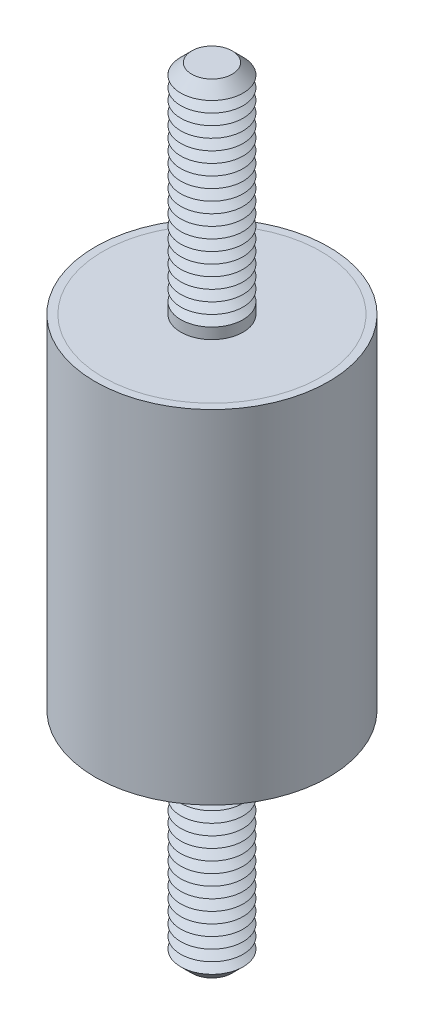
ISO-10303-21;
HEADER;
FILE_DESCRIPTION(('STEP AP214'),'2;1');
FILE_NAME('part.step','',(''),(''),'','','');
FILE_SCHEMA(('AUTOMOTIVE_DESIGN { 1 0 10303 214 1 1 1 1 }'));
ENDSEC;
DATA;
#1=APPLICATION_CONTEXT('core data for automotive mechanical design processes');
#2=APPLICATION_PROTOCOL_DEFINITION('international standard','automotive_design',2000,#1);
#3=PRODUCT_CONTEXT('',#1,'mechanical');
#4=PRODUCT('Part','Part','',(#3));
#5=PRODUCT_RELATED_PRODUCT_CATEGORY('part','',(#4));
#6=PRODUCT_DEFINITION_FORMATION('','',#4);
#7=PRODUCT_DEFINITION_CONTEXT('part definition',#1,'design');
#8=PRODUCT_DEFINITION('design','',#6,#7);
#9=PRODUCT_DEFINITION_SHAPE('','',#8);
#10=(LENGTH_UNIT() NAMED_UNIT(*) SI_UNIT(.MILLI.,.METRE.));
#11=(NAMED_UNIT(*) PLANE_ANGLE_UNIT() SI_UNIT($,.RADIAN.));
#12=(NAMED_UNIT(*) SI_UNIT($,.STERADIAN.) SOLID_ANGLE_UNIT());
#13=UNCERTAINTY_MEASURE_WITH_UNIT(LENGTH_MEASURE(1.E-05),#10,'distance_accuracy_value','');
#14=(GEOMETRIC_REPRESENTATION_CONTEXT(3) GLOBAL_UNCERTAINTY_ASSIGNED_CONTEXT((#13)) GLOBAL_UNIT_ASSIGNED_CONTEXT((#10,
#11,#12)) REPRESENTATION_CONTEXT('',''));
#15=CARTESIAN_POINT('',(0.,0.,0.));
#16=DIRECTION('',(0.,0.,1.));
#17=DIRECTION('',(1.,0.,0.));
#18=AXIS2_PLACEMENT_3D('',#15,#16,#17);
#19=CARTESIAN_POINT('',(0.,-25.,0.));
#20=DIRECTION('',(0.,1.,0.));
#21=DIRECTION('',(0.,0.,1.));
#22=AXIS2_PLACEMENT_3D('',#19,#20,#21);
#23=CYLINDRICAL_SURFACE('',#22,2.);
#24=CARTESIAN_POINT('',(0.,-11.,0.));
#25=DIRECTION('',(0.,-1.,0.));
#26=DIRECTION('',(0.,0.,-1.));
#27=AXIS2_PLACEMENT_3D('',#24,#25,#26);
#28=CIRCLE('',#27,2.);
#29=CARTESIAN_POINT('',(0.,-11.,-2.));
#30=VERTEX_POINT('',#29);
#31=EDGE_CURVE('P0_E21',#30,#30,#28,.T.);
#32=ORIENTED_EDGE('',*,*,#31,.T.);
#33=EDGE_LOOP('',(#32));
#34=FACE_BOUND('',#33,.T.);
#35=CARTESIAN_POINT('',(0.,-11.7,0.));
#36=DIRECTION('',(0.,1.,0.));
#37=DIRECTION('',(0.,0.,1.));
#38=AXIS2_PLACEMENT_3D('',#35,#36,#37);
#39=CIRCLE('',#38,2.);
#40=CARTESIAN_POINT('',(0.,-11.7,2.));
#41=VERTEX_POINT('',#40);
#42=EDGE_CURVE('P0_E33',#41,#41,#39,.T.);
#43=ORIENTED_EDGE('',*,*,#42,.T.);
#44=EDGE_LOOP('',(#43));
#45=FACE_BOUND('',#44,.T.);
#46=ADVANCED_FACE('P0_F14',(#34,#45),#23,.T.);
#47=CARTESIAN_POINT('',(0.,-11.,0.));
#48=DIRECTION('',(0.,1.,0.));
#49=DIRECTION('',(0.,0.,1.));
#50=AXIS2_PLACEMENT_3D('',#47,#48,#49);
#51=CYLINDRICAL_SURFACE('',#50,7.);
#52=CARTESIAN_POINT('',(0.,-11.,0.));
#53=DIRECTION('',(0.,1.,0.));
#54=DIRECTION('',(0.,0.,1.));
#55=AXIS2_PLACEMENT_3D('',#52,#53,#54);
#56=CIRCLE('',#55,7.);
#57=CARTESIAN_POINT('',(0.,-11.,7.));
#58=VERTEX_POINT('',#57);
#59=EDGE_CURVE('P0_E25',#58,#58,#56,.T.);
#60=ORIENTED_EDGE('',*,*,#59,.T.);
#61=EDGE_LOOP('',(#60));
#62=FACE_BOUND('',#61,.T.);
#63=CARTESIAN_POINT('',(0.,-10.,0.));
#64=DIRECTION('',(0.,1.,0.));
#65=DIRECTION('',(0.,0.,1.));
#66=AXIS2_PLACEMENT_3D('',#63,#64,#65);
#67=CIRCLE('',#66,7.);
#68=CARTESIAN_POINT('',(0.,-10.,7.));
#69=VERTEX_POINT('',#68);
#70=EDGE_CURVE('P0_E30',#69,#69,#67,.T.);
#71=ORIENTED_EDGE('',*,*,#70,.F.);
#72=EDGE_LOOP('',(#71));
#73=FACE_BOUND('',#72,.T.);
#74=ADVANCED_FACE('P0_F169',(#62,#73),#51,.T.);
#75=CARTESIAN_POINT('',(0.,-11.,0.));
#76=DIRECTION('',(0.,1.,0.));
#77=DIRECTION('',(0.,0.,1.));
#78=AXIS2_PLACEMENT_3D('',#75,#76,#77);
#79=PLANE('',#78);
#80=ORIENTED_EDGE('',*,*,#31,.F.);
#81=EDGE_LOOP('',(#80));
#82=FACE_BOUND('',#81,.T.);
#83=ORIENTED_EDGE('',*,*,#59,.F.);
#84=EDGE_LOOP('',(#83));
#85=FACE_BOUND('',#84,.T.);
#86=ADVANCED_FACE('P0_F174',(#82,#85),#79,.F.);
#87=CARTESIAN_POINT('',(0.,-10.,0.));
#88=DIRECTION('',(0.,1.,0.));
#89=DIRECTION('',(0.,0.,1.));
#90=AXIS2_PLACEMENT_3D('',#87,#88,#89);
#91=PLANE('',#90);
#92=ORIENTED_EDGE('',*,*,#70,.T.);
#93=EDGE_LOOP('',(#92));
#94=FACE_BOUND('',#93,.T.);
#95=ADVANCED_FACE('P0_F180',(#94),#91,.T.);
#96=CARTESIAN_POINT('',(0.,-11.7,0.));
#97=DIRECTION('',(0.,1.,0.));
#98=DIRECTION('',(0.,0.,1.));
#99=AXIS2_PLACEMENT_3D('',#96,#97,#98);
#100=CONICAL_SURFACE('',#99,2.,1.0471975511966);
#101=CARTESIAN_POINT('',(0.,-12.05,0.));
#102=DIRECTION('',(0.,1.,0.));
#103=DIRECTION('',(0.,0.,1.));
#104=AXIS2_PLACEMENT_3D('',#101,#102,#103);
#105=CIRCLE('',#104,1.39378221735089);
#106=CARTESIAN_POINT('',(0.,-12.05,1.39378221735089));
#107=VERTEX_POINT('',#106);
#108=EDGE_CURVE('P0_E39',#107,#107,#105,.T.);
#109=ORIENTED_EDGE('',*,*,#108,.T.);
#110=EDGE_LOOP('',(#109));
#111=FACE_BOUND('',#110,.T.);
#112=ORIENTED_EDGE('',*,*,#42,.F.);
#113=EDGE_LOOP('',(#112));
#114=FACE_BOUND('',#113,.T.);
#115=ADVANCED_FACE('P0_F183',(#111,#114),#100,.T.);
#116=CARTESIAN_POINT('',(0.,-12.05,0.));
#117=DIRECTION('',(0.,-1.,0.));
#118=DIRECTION('',(0.,0.,-1.));
#119=AXIS2_PLACEMENT_3D('',#116,#117,#118);
#120=CONICAL_SURFACE('',#119,1.39378221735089,1.0471975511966);
#121=CARTESIAN_POINT('',(0.,-12.4,0.));
#122=DIRECTION('',(0.,1.,0.));
#123=DIRECTION('',(0.,0.,1.));
#124=AXIS2_PLACEMENT_3D('',#121,#122,#123);
#125=CIRCLE('',#124,2.);
#126=CARTESIAN_POINT('',(0.,-12.4,2.));
#127=VERTEX_POINT('',#126);
#128=EDGE_CURVE('P0_E43',#127,#127,#125,.T.);
#129=ORIENTED_EDGE('',*,*,#128,.T.);
#130=EDGE_LOOP('',(#129));
#131=FACE_BOUND('',#130,.T.);
#132=ORIENTED_EDGE('',*,*,#108,.F.);
#133=EDGE_LOOP('',(#132));
#134=FACE_BOUND('',#133,.T.);
#135=ADVANCED_FACE('P0_F187',(#131,#134),#120,.T.);
#136=CARTESIAN_POINT('',(0.,-12.4,0.));
#137=DIRECTION('',(0.,1.,0.));
#138=DIRECTION('',(0.,0.,1.));
#139=AXIS2_PLACEMENT_3D('',#136,#137,#138);
#140=CONICAL_SURFACE('',#139,2.,1.0471975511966);
#141=CARTESIAN_POINT('',(0.,-12.75,0.));
#142=DIRECTION('',(0.,1.,0.));
#143=DIRECTION('',(0.,0.,1.));
#144=AXIS2_PLACEMENT_3D('',#141,#142,#143);
#145=CIRCLE('',#144,1.39378221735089);
#146=CARTESIAN_POINT('',(0.,-12.75,1.39378221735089));
#147=VERTEX_POINT('',#146);
#148=EDGE_CURVE('P0_E47',#147,#147,#145,.T.);
#149=ORIENTED_EDGE('',*,*,#148,.T.);
#150=EDGE_LOOP('',(#149));
#151=FACE_BOUND('',#150,.T.);
#152=ORIENTED_EDGE('',*,*,#128,.F.);
#153=EDGE_LOOP('',(#152));
#154=FACE_BOUND('',#153,.T.);
#155=ADVANCED_FACE('P0_F191',(#151,#154),#140,.T.);
#156=CARTESIAN_POINT('',(0.,-12.75,0.));
#157=DIRECTION('',(0.,-1.,0.));
#158=DIRECTION('',(0.,0.,-1.));
#159=AXIS2_PLACEMENT_3D('',#156,#157,#158);
#160=CONICAL_SURFACE('',#159,1.39378221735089,1.0471975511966);
#161=CARTESIAN_POINT('',(0.,-13.1,0.));
#162=DIRECTION('',(0.,1.,0.));
#163=DIRECTION('',(0.,0.,1.));
#164=AXIS2_PLACEMENT_3D('',#161,#162,#163);
#165=CIRCLE('',#164,2.);
#166=CARTESIAN_POINT('',(0.,-13.1,2.));
#167=VERTEX_POINT('',#166);
#168=EDGE_CURVE('P0_E52',#167,#167,#165,.T.);
#169=ORIENTED_EDGE('',*,*,#168,.T.);
#170=EDGE_LOOP('',(#169));
#171=FACE_BOUND('',#170,.T.);
#172=ORIENTED_EDGE('',*,*,#148,.F.);
#173=EDGE_LOOP('',(#172));
#174=FACE_BOUND('',#173,.T.);
#175=ADVANCED_FACE('P0_F198',(#171,#174),#160,.T.);
#176=CARTESIAN_POINT('',(0.,-13.1,0.));
#177=DIRECTION('',(0.,1.,0.));
#178=DIRECTION('',(0.,0.,1.));
#179=AXIS2_PLACEMENT_3D('',#176,#177,#178);
#180=CONICAL_SURFACE('',#179,2.,1.0471975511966);
#181=CARTESIAN_POINT('',(0.,-13.45,0.));
#182=DIRECTION('',(0.,1.,0.));
#183=DIRECTION('',(0.,0.,1.));
#184=AXIS2_PLACEMENT_3D('',#181,#182,#183);
#185=CIRCLE('',#184,1.39378221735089);
#186=CARTESIAN_POINT('',(0.,-13.45,1.39378221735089));
#187=VERTEX_POINT('',#186);
#188=EDGE_CURVE('P0_E55',#187,#187,#185,.T.);
#189=ORIENTED_EDGE('',*,*,#188,.T.);
#190=EDGE_LOOP('',(#189));
#191=FACE_BOUND('',#190,.T.);
#192=ORIENTED_EDGE('',*,*,#168,.F.);
#193=EDGE_LOOP('',(#192));
#194=FACE_BOUND('',#193,.T.);
#195=ADVANCED_FACE('P0_F202',(#191,#194),#180,.T.);
#196=CARTESIAN_POINT('',(0.,-13.45,0.));
#197=DIRECTION('',(0.,-1.,0.));
#198=DIRECTION('',(0.,0.,-1.));
#199=AXIS2_PLACEMENT_3D('',#196,#197,#198);
#200=CONICAL_SURFACE('',#199,1.39378221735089,1.0471975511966);
#201=CARTESIAN_POINT('',(0.,-13.8,0.));
#202=DIRECTION('',(0.,1.,0.));
#203=DIRECTION('',(0.,0.,1.));
#204=AXIS2_PLACEMENT_3D('',#201,#202,#203);
#205=CIRCLE('',#204,2.);
#206=CARTESIAN_POINT('',(0.,-13.8,2.));
#207=VERTEX_POINT('',#206);
#208=EDGE_CURVE('P0_E58',#207,#207,#205,.T.);
#209=ORIENTED_EDGE('',*,*,#208,.T.);
#210=EDGE_LOOP('',(#209));
#211=FACE_BOUND('',#210,.T.);
#212=ORIENTED_EDGE('',*,*,#188,.F.);
#213=EDGE_LOOP('',(#212));
#214=FACE_BOUND('',#213,.T.);
#215=ADVANCED_FACE('P0_F206',(#211,#214),#200,.T.);
#216=CARTESIAN_POINT('',(0.,-13.8,0.));
#217=DIRECTION('',(0.,1.,0.));
#218=DIRECTION('',(0.,0.,1.));
#219=AXIS2_PLACEMENT_3D('',#216,#217,#218);
#220=CONICAL_SURFACE('',#219,2.,1.0471975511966);
#221=CARTESIAN_POINT('',(0.,-14.15,0.));
#222=DIRECTION('',(0.,1.,0.));
#223=DIRECTION('',(0.,0.,1.));
#224=AXIS2_PLACEMENT_3D('',#221,#222,#223);
#225=CIRCLE('',#224,1.39378221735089);
#226=CARTESIAN_POINT('',(0.,-14.15,1.39378221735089));
#227=VERTEX_POINT('',#226);
#228=EDGE_CURVE('P0_E61',#227,#227,#225,.T.);
#229=ORIENTED_EDGE('',*,*,#228,.T.);
#230=EDGE_LOOP('',(#229));
#231=FACE_BOUND('',#230,.T.);
#232=ORIENTED_EDGE('',*,*,#208,.F.);
#233=EDGE_LOOP('',(#232));
#234=FACE_BOUND('',#233,.T.);
#235=ADVANCED_FACE('P0_F210',(#231,#234),#220,.T.);
#236=CARTESIAN_POINT('',(0.,-14.15,0.));
#237=DIRECTION('',(0.,-1.,0.));
#238=DIRECTION('',(0.,0.,-1.));
#239=AXIS2_PLACEMENT_3D('',#236,#237,#238);
#240=CONICAL_SURFACE('',#239,1.39378221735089,1.0471975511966);
#241=CARTESIAN_POINT('',(0.,-14.5,0.));
#242=DIRECTION('',(0.,1.,0.));
#243=DIRECTION('',(0.,0.,1.));
#244=AXIS2_PLACEMENT_3D('',#241,#242,#243);
#245=CIRCLE('',#244,2.);
#246=CARTESIAN_POINT('',(0.,-14.5,2.));
#247=VERTEX_POINT('',#246);
#248=EDGE_CURVE('P0_E64',#247,#247,#245,.T.);
#249=ORIENTED_EDGE('',*,*,#248,.T.);
#250=EDGE_LOOP('',(#249));
#251=FACE_BOUND('',#250,.T.);
#252=ORIENTED_EDGE('',*,*,#228,.F.);
#253=EDGE_LOOP('',(#252));
#254=FACE_BOUND('',#253,.T.);
#255=ADVANCED_FACE('P0_F214',(#251,#254),#240,.T.);
#256=CARTESIAN_POINT('',(0.,-14.5,0.));
#257=DIRECTION('',(0.,1.,0.));
#258=DIRECTION('',(0.,0.,1.));
#259=AXIS2_PLACEMENT_3D('',#256,#257,#258);
#260=CONICAL_SURFACE('',#259,2.,1.0471975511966);
#261=CARTESIAN_POINT('',(0.,-14.85,0.));
#262=DIRECTION('',(0.,1.,0.));
#263=DIRECTION('',(0.,0.,1.));
#264=AXIS2_PLACEMENT_3D('',#261,#262,#263);
#265=CIRCLE('',#264,1.39378221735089);
#266=CARTESIAN_POINT('',(0.,-14.85,1.39378221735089));
#267=VERTEX_POINT('',#266);
#268=EDGE_CURVE('P0_E67',#267,#267,#265,.T.);
#269=ORIENTED_EDGE('',*,*,#268,.T.);
#270=EDGE_LOOP('',(#269));
#271=FACE_BOUND('',#270,.T.);
#272=ORIENTED_EDGE('',*,*,#248,.F.);
#273=EDGE_LOOP('',(#272));
#274=FACE_BOUND('',#273,.T.);
#275=ADVANCED_FACE('P0_F218',(#271,#274),#260,.T.);
#276=CARTESIAN_POINT('',(0.,-14.85,0.));
#277=DIRECTION('',(0.,-1.,0.));
#278=DIRECTION('',(0.,0.,-1.));
#279=AXIS2_PLACEMENT_3D('',#276,#277,#278);
#280=CONICAL_SURFACE('',#279,1.39378221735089,1.0471975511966);
#281=CARTESIAN_POINT('',(0.,-15.2,0.));
#282=DIRECTION('',(0.,1.,0.));
#283=DIRECTION('',(0.,0.,1.));
#284=AXIS2_PLACEMENT_3D('',#281,#282,#283);
#285=CIRCLE('',#284,2.);
#286=CARTESIAN_POINT('',(0.,-15.2,2.));
#287=VERTEX_POINT('',#286);
#288=EDGE_CURVE('P0_E70',#287,#287,#285,.T.);
#289=ORIENTED_EDGE('',*,*,#288,.T.);
#290=EDGE_LOOP('',(#289));
#291=FACE_BOUND('',#290,.T.);
#292=ORIENTED_EDGE('',*,*,#268,.F.);
#293=EDGE_LOOP('',(#292));
#294=FACE_BOUND('',#293,.T.);
#295=ADVANCED_FACE('P0_F222',(#291,#294),#280,.T.);
#296=CARTESIAN_POINT('',(0.,-15.2,0.));
#297=DIRECTION('',(0.,1.,0.));
#298=DIRECTION('',(0.,0.,1.));
#299=AXIS2_PLACEMENT_3D('',#296,#297,#298);
#300=CONICAL_SURFACE('',#299,2.,1.0471975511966);
#301=CARTESIAN_POINT('',(0.,-15.55,0.));
#302=DIRECTION('',(0.,1.,0.));
#303=DIRECTION('',(0.,0.,1.));
#304=AXIS2_PLACEMENT_3D('',#301,#302,#303);
#305=CIRCLE('',#304,1.39378221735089);
#306=CARTESIAN_POINT('',(0.,-15.55,1.39378221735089));
#307=VERTEX_POINT('',#306);
#308=EDGE_CURVE('P0_E73',#307,#307,#305,.T.);
#309=ORIENTED_EDGE('',*,*,#308,.T.);
#310=EDGE_LOOP('',(#309));
#311=FACE_BOUND('',#310,.T.);
#312=ORIENTED_EDGE('',*,*,#288,.F.);
#313=EDGE_LOOP('',(#312));
#314=FACE_BOUND('',#313,.T.);
#315=ADVANCED_FACE('P0_F226',(#311,#314),#300,.T.);
#316=CARTESIAN_POINT('',(0.,-15.55,0.));
#317=DIRECTION('',(0.,-1.,0.));
#318=DIRECTION('',(0.,0.,-1.));
#319=AXIS2_PLACEMENT_3D('',#316,#317,#318);
#320=CONICAL_SURFACE('',#319,1.39378221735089,1.0471975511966);
#321=CARTESIAN_POINT('',(0.,-15.9,0.));
#322=DIRECTION('',(0.,1.,0.));
#323=DIRECTION('',(0.,0.,1.));
#324=AXIS2_PLACEMENT_3D('',#321,#322,#323);
#325=CIRCLE('',#324,2.);
#326=CARTESIAN_POINT('',(0.,-15.9,2.));
#327=VERTEX_POINT('',#326);
#328=EDGE_CURVE('P0_E76',#327,#327,#325,.T.);
#329=ORIENTED_EDGE('',*,*,#328,.T.);
#330=EDGE_LOOP('',(#329));
#331=FACE_BOUND('',#330,.T.);
#332=ORIENTED_EDGE('',*,*,#308,.F.);
#333=EDGE_LOOP('',(#332));
#334=FACE_BOUND('',#333,.T.);
#335=ADVANCED_FACE('P0_F230',(#331,#334),#320,.T.);
#336=CARTESIAN_POINT('',(0.,-15.9,0.));
#337=DIRECTION('',(0.,1.,0.));
#338=DIRECTION('',(0.,0.,1.));
#339=AXIS2_PLACEMENT_3D('',#336,#337,#338);
#340=CONICAL_SURFACE('',#339,2.,1.0471975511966);
#341=CARTESIAN_POINT('',(0.,-16.25,0.));
#342=DIRECTION('',(0.,1.,0.));
#343=DIRECTION('',(0.,0.,1.));
#344=AXIS2_PLACEMENT_3D('',#341,#342,#343);
#345=CIRCLE('',#344,1.39378221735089);
#346=CARTESIAN_POINT('',(0.,-16.25,1.39378221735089));
#347=VERTEX_POINT('',#346);
#348=EDGE_CURVE('P0_E79',#347,#347,#345,.T.);
#349=ORIENTED_EDGE('',*,*,#348,.T.);
#350=EDGE_LOOP('',(#349));
#351=FACE_BOUND('',#350,.T.);
#352=ORIENTED_EDGE('',*,*,#328,.F.);
#353=EDGE_LOOP('',(#352));
#354=FACE_BOUND('',#353,.T.);
#355=ADVANCED_FACE('P0_F234',(#351,#354),#340,.T.);
#356=CARTESIAN_POINT('',(0.,-16.25,0.));
#357=DIRECTION('',(0.,-1.,0.));
#358=DIRECTION('',(0.,0.,-1.));
#359=AXIS2_PLACEMENT_3D('',#356,#357,#358);
#360=CONICAL_SURFACE('',#359,1.39378221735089,1.0471975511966);
#361=CARTESIAN_POINT('',(0.,-16.6,0.));
#362=DIRECTION('',(0.,1.,0.));
#363=DIRECTION('',(0.,0.,1.));
#364=AXIS2_PLACEMENT_3D('',#361,#362,#363);
#365=CIRCLE('',#364,2.);
#366=CARTESIAN_POINT('',(0.,-16.6,2.));
#367=VERTEX_POINT('',#366);
#368=EDGE_CURVE('P0_E82',#367,#367,#365,.T.);
#369=ORIENTED_EDGE('',*,*,#368,.T.);
#370=EDGE_LOOP('',(#369));
#371=FACE_BOUND('',#370,.T.);
#372=ORIENTED_EDGE('',*,*,#348,.F.);
#373=EDGE_LOOP('',(#372));
#374=FACE_BOUND('',#373,.T.);
#375=ADVANCED_FACE('P0_F238',(#371,#374),#360,.T.);
#376=CARTESIAN_POINT('',(0.,-16.6,0.));
#377=DIRECTION('',(0.,1.,0.));
#378=DIRECTION('',(0.,0.,1.));
#379=AXIS2_PLACEMENT_3D('',#376,#377,#378);
#380=CONICAL_SURFACE('',#379,2.,1.0471975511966);
#381=CARTESIAN_POINT('',(0.,-16.95,0.));
#382=DIRECTION('',(0.,1.,0.));
#383=DIRECTION('',(0.,0.,1.));
#384=AXIS2_PLACEMENT_3D('',#381,#382,#383);
#385=CIRCLE('',#384,1.39378221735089);
#386=CARTESIAN_POINT('',(0.,-16.95,1.39378221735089));
#387=VERTEX_POINT('',#386);
#388=EDGE_CURVE('P0_E85',#387,#387,#385,.T.);
#389=ORIENTED_EDGE('',*,*,#388,.T.);
#390=EDGE_LOOP('',(#389));
#391=FACE_BOUND('',#390,.T.);
#392=ORIENTED_EDGE('',*,*,#368,.F.);
#393=EDGE_LOOP('',(#392));
#394=FACE_BOUND('',#393,.T.);
#395=ADVANCED_FACE('P0_F242',(#391,#394),#380,.T.);
#396=CARTESIAN_POINT('',(0.,-16.95,0.));
#397=DIRECTION('',(0.,-1.,0.));
#398=DIRECTION('',(0.,0.,-1.));
#399=AXIS2_PLACEMENT_3D('',#396,#397,#398);
#400=CONICAL_SURFACE('',#399,1.39378221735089,1.0471975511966);
#401=CARTESIAN_POINT('',(0.,-17.3,0.));
#402=DIRECTION('',(0.,1.,0.));
#403=DIRECTION('',(0.,0.,1.));
#404=AXIS2_PLACEMENT_3D('',#401,#402,#403);
#405=CIRCLE('',#404,2.);
#406=CARTESIAN_POINT('',(0.,-17.3,2.));
#407=VERTEX_POINT('',#406);
#408=EDGE_CURVE('P0_E88',#407,#407,#405,.T.);
#409=ORIENTED_EDGE('',*,*,#408,.T.);
#410=EDGE_LOOP('',(#409));
#411=FACE_BOUND('',#410,.T.);
#412=ORIENTED_EDGE('',*,*,#388,.F.);
#413=EDGE_LOOP('',(#412));
#414=FACE_BOUND('',#413,.T.);
#415=ADVANCED_FACE('P0_F246',(#411,#414),#400,.T.);
#416=CARTESIAN_POINT('',(0.,-17.3,0.));
#417=DIRECTION('',(0.,1.,0.));
#418=DIRECTION('',(0.,0.,1.));
#419=AXIS2_PLACEMENT_3D('',#416,#417,#418);
#420=CONICAL_SURFACE('',#419,2.,1.0471975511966);
#421=CARTESIAN_POINT('',(0.,-17.65,0.));
#422=DIRECTION('',(0.,1.,0.));
#423=DIRECTION('',(0.,0.,1.));
#424=AXIS2_PLACEMENT_3D('',#421,#422,#423);
#425=CIRCLE('',#424,1.39378221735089);
#426=CARTESIAN_POINT('',(0.,-17.65,1.39378221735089));
#427=VERTEX_POINT('',#426);
#428=EDGE_CURVE('P0_E91',#427,#427,#425,.T.);
#429=ORIENTED_EDGE('',*,*,#428,.T.);
#430=EDGE_LOOP('',(#429));
#431=FACE_BOUND('',#430,.T.);
#432=ORIENTED_EDGE('',*,*,#408,.F.);
#433=EDGE_LOOP('',(#432));
#434=FACE_BOUND('',#433,.T.);
#435=ADVANCED_FACE('P0_F250',(#431,#434),#420,.T.);
#436=CARTESIAN_POINT('',(0.,-17.65,0.));
#437=DIRECTION('',(0.,-1.,0.));
#438=DIRECTION('',(0.,0.,-1.));
#439=AXIS2_PLACEMENT_3D('',#436,#437,#438);
#440=CONICAL_SURFACE('',#439,1.39378221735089,1.0471975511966);
#441=CARTESIAN_POINT('',(0.,-18.,0.));
#442=DIRECTION('',(0.,1.,0.));
#443=DIRECTION('',(0.,0.,1.));
#444=AXIS2_PLACEMENT_3D('',#441,#442,#443);
#445=CIRCLE('',#444,2.);
#446=CARTESIAN_POINT('',(0.,-18.,2.));
#447=VERTEX_POINT('',#446);
#448=EDGE_CURVE('P0_E94',#447,#447,#445,.T.);
#449=ORIENTED_EDGE('',*,*,#448,.T.);
#450=EDGE_LOOP('',(#449));
#451=FACE_BOUND('',#450,.T.);
#452=ORIENTED_EDGE('',*,*,#428,.F.);
#453=EDGE_LOOP('',(#452));
#454=FACE_BOUND('',#453,.T.);
#455=ADVANCED_FACE('P0_F254',(#451,#454),#440,.T.);
#456=CARTESIAN_POINT('',(0.,-18.,0.));
#457=DIRECTION('',(0.,1.,0.));
#458=DIRECTION('',(0.,0.,1.));
#459=AXIS2_PLACEMENT_3D('',#456,#457,#458);
#460=CONICAL_SURFACE('',#459,2.,1.0471975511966);
#461=CARTESIAN_POINT('',(0.,-18.35,0.));
#462=DIRECTION('',(0.,1.,0.));
#463=DIRECTION('',(0.,0.,1.));
#464=AXIS2_PLACEMENT_3D('',#461,#462,#463);
#465=CIRCLE('',#464,1.39378221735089);
#466=CARTESIAN_POINT('',(0.,-18.35,1.39378221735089));
#467=VERTEX_POINT('',#466);
#468=EDGE_CURVE('P0_E97',#467,#467,#465,.T.);
#469=ORIENTED_EDGE('',*,*,#468,.T.);
#470=EDGE_LOOP('',(#469));
#471=FACE_BOUND('',#470,.T.);
#472=ORIENTED_EDGE('',*,*,#448,.F.);
#473=EDGE_LOOP('',(#472));
#474=FACE_BOUND('',#473,.T.);
#475=ADVANCED_FACE('P0_F258',(#471,#474),#460,.T.);
#476=CARTESIAN_POINT('',(0.,-18.35,0.));
#477=DIRECTION('',(0.,-1.,0.));
#478=DIRECTION('',(0.,0.,-1.));
#479=AXIS2_PLACEMENT_3D('',#476,#477,#478);
#480=CONICAL_SURFACE('',#479,1.39378221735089,1.0471975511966);
#481=CARTESIAN_POINT('',(0.,-18.7,0.));
#482=DIRECTION('',(0.,1.,0.));
#483=DIRECTION('',(0.,0.,1.));
#484=AXIS2_PLACEMENT_3D('',#481,#482,#483);
#485=CIRCLE('',#484,2.);
#486=CARTESIAN_POINT('',(0.,-18.7,2.));
#487=VERTEX_POINT('',#486);
#488=EDGE_CURVE('P0_E100',#487,#487,#485,.T.);
#489=ORIENTED_EDGE('',*,*,#488,.T.);
#490=EDGE_LOOP('',(#489));
#491=FACE_BOUND('',#490,.T.);
#492=ORIENTED_EDGE('',*,*,#468,.F.);
#493=EDGE_LOOP('',(#492));
#494=FACE_BOUND('',#493,.T.);
#495=ADVANCED_FACE('P0_F262',(#491,#494),#480,.T.);
#496=CARTESIAN_POINT('',(0.,-18.7,0.));
#497=DIRECTION('',(0.,1.,0.));
#498=DIRECTION('',(0.,0.,1.));
#499=AXIS2_PLACEMENT_3D('',#496,#497,#498);
#500=CONICAL_SURFACE('',#499,2.,1.0471975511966);
#501=CARTESIAN_POINT('',(0.,-19.05,0.));
#502=DIRECTION('',(0.,1.,0.));
#503=DIRECTION('',(0.,0.,1.));
#504=AXIS2_PLACEMENT_3D('',#501,#502,#503);
#505=CIRCLE('',#504,1.39378221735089);
#506=CARTESIAN_POINT('',(0.,-19.05,1.39378221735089));
#507=VERTEX_POINT('',#506);
#508=EDGE_CURVE('P0_E103',#507,#507,#505,.T.);
#509=ORIENTED_EDGE('',*,*,#508,.T.);
#510=EDGE_LOOP('',(#509));
#511=FACE_BOUND('',#510,.T.);
#512=ORIENTED_EDGE('',*,*,#488,.F.);
#513=EDGE_LOOP('',(#512));
#514=FACE_BOUND('',#513,.T.);
#515=ADVANCED_FACE('P0_F266',(#511,#514),#500,.T.);
#516=CARTESIAN_POINT('',(0.,-19.05,0.));
#517=DIRECTION('',(0.,-1.,0.));
#518=DIRECTION('',(0.,0.,-1.));
#519=AXIS2_PLACEMENT_3D('',#516,#517,#518);
#520=CONICAL_SURFACE('',#519,1.39378221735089,1.0471975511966);
#521=CARTESIAN_POINT('',(0.,-19.4,0.));
#522=DIRECTION('',(0.,1.,0.));
#523=DIRECTION('',(0.,0.,1.));
#524=AXIS2_PLACEMENT_3D('',#521,#522,#523);
#525=CIRCLE('',#524,2.);
#526=CARTESIAN_POINT('',(0.,-19.4,2.));
#527=VERTEX_POINT('',#526);
#528=EDGE_CURVE('P0_E106',#527,#527,#525,.T.);
#529=ORIENTED_EDGE('',*,*,#528,.T.);
#530=EDGE_LOOP('',(#529));
#531=FACE_BOUND('',#530,.T.);
#532=ORIENTED_EDGE('',*,*,#508,.F.);
#533=EDGE_LOOP('',(#532));
#534=FACE_BOUND('',#533,.T.);
#535=ADVANCED_FACE('P0_F270',(#531,#534),#520,.T.);
#536=CARTESIAN_POINT('',(0.,-19.4,0.));
#537=DIRECTION('',(0.,1.,0.));
#538=DIRECTION('',(0.,0.,1.));
#539=AXIS2_PLACEMENT_3D('',#536,#537,#538);
#540=CONICAL_SURFACE('',#539,2.,1.0471975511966);
#541=CARTESIAN_POINT('',(0.,-19.75,0.));
#542=DIRECTION('',(0.,1.,0.));
#543=DIRECTION('',(0.,0.,1.));
#544=AXIS2_PLACEMENT_3D('',#541,#542,#543);
#545=CIRCLE('',#544,1.39378221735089);
#546=CARTESIAN_POINT('',(0.,-19.75,1.39378221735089));
#547=VERTEX_POINT('',#546);
#548=EDGE_CURVE('P0_E109',#547,#547,#545,.T.);
#549=ORIENTED_EDGE('',*,*,#548,.T.);
#550=EDGE_LOOP('',(#549));
#551=FACE_BOUND('',#550,.T.);
#552=ORIENTED_EDGE('',*,*,#528,.F.);
#553=EDGE_LOOP('',(#552));
#554=FACE_BOUND('',#553,.T.);
#555=ADVANCED_FACE('P0_F274',(#551,#554),#540,.T.);
#556=CARTESIAN_POINT('',(0.,-19.75,0.));
#557=DIRECTION('',(0.,-1.,0.));
#558=DIRECTION('',(0.,0.,-1.));
#559=AXIS2_PLACEMENT_3D('',#556,#557,#558);
#560=CONICAL_SURFACE('',#559,1.39378221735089,1.0471975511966);
#561=CARTESIAN_POINT('',(0.,-20.1,0.));
#562=DIRECTION('',(0.,1.,0.));
#563=DIRECTION('',(0.,0.,1.));
#564=AXIS2_PLACEMENT_3D('',#561,#562,#563);
#565=CIRCLE('',#564,2.);
#566=CARTESIAN_POINT('',(0.,-20.1,2.));
#567=VERTEX_POINT('',#566);
#568=EDGE_CURVE('P0_E112',#567,#567,#565,.T.);
#569=ORIENTED_EDGE('',*,*,#568,.T.);
#570=EDGE_LOOP('',(#569));
#571=FACE_BOUND('',#570,.T.);
#572=ORIENTED_EDGE('',*,*,#548,.F.);
#573=EDGE_LOOP('',(#572));
#574=FACE_BOUND('',#573,.T.);
#575=ADVANCED_FACE('P0_F278',(#571,#574),#560,.T.);
#576=CARTESIAN_POINT('',(0.,-20.1,0.));
#577=DIRECTION('',(0.,1.,0.));
#578=DIRECTION('',(0.,0.,1.));
#579=AXIS2_PLACEMENT_3D('',#576,#577,#578);
#580=CONICAL_SURFACE('',#579,2.,1.0471975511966);
#581=CARTESIAN_POINT('',(0.,-20.45,0.));
#582=DIRECTION('',(0.,1.,0.));
#583=DIRECTION('',(0.,0.,1.));
#584=AXIS2_PLACEMENT_3D('',#581,#582,#583);
#585=CIRCLE('',#584,1.39378221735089);
#586=CARTESIAN_POINT('',(0.,-20.45,1.39378221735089));
#587=VERTEX_POINT('',#586);
#588=EDGE_CURVE('P0_E115',#587,#587,#585,.T.);
#589=ORIENTED_EDGE('',*,*,#588,.T.);
#590=EDGE_LOOP('',(#589));
#591=FACE_BOUND('',#590,.T.);
#592=ORIENTED_EDGE('',*,*,#568,.F.);
#593=EDGE_LOOP('',(#592));
#594=FACE_BOUND('',#593,.T.);
#595=ADVANCED_FACE('P0_F282',(#591,#594),#580,.T.);
#596=CARTESIAN_POINT('',(0.,-20.45,0.));
#597=DIRECTION('',(0.,-1.,0.));
#598=DIRECTION('',(0.,0.,-1.));
#599=AXIS2_PLACEMENT_3D('',#596,#597,#598);
#600=CONICAL_SURFACE('',#599,1.39378221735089,1.0471975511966);
#601=CARTESIAN_POINT('',(0.,-20.8,0.));
#602=DIRECTION('',(0.,1.,0.));
#603=DIRECTION('',(0.,0.,1.));
#604=AXIS2_PLACEMENT_3D('',#601,#602,#603);
#605=CIRCLE('',#604,2.);
#606=CARTESIAN_POINT('',(0.,-20.8,2.));
#607=VERTEX_POINT('',#606);
#608=EDGE_CURVE('P0_E118',#607,#607,#605,.T.);
#609=ORIENTED_EDGE('',*,*,#608,.T.);
#610=EDGE_LOOP('',(#609));
#611=FACE_BOUND('',#610,.T.);
#612=ORIENTED_EDGE('',*,*,#588,.F.);
#613=EDGE_LOOP('',(#612));
#614=FACE_BOUND('',#613,.T.);
#615=ADVANCED_FACE('P0_F286',(#611,#614),#600,.T.);
#616=CARTESIAN_POINT('',(0.,-20.8,0.));
#617=DIRECTION('',(0.,1.,0.));
#618=DIRECTION('',(0.,0.,1.));
#619=AXIS2_PLACEMENT_3D('',#616,#617,#618);
#620=CONICAL_SURFACE('',#619,2.,1.0471975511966);
#621=CARTESIAN_POINT('',(0.,-21.15,0.));
#622=DIRECTION('',(0.,1.,0.));
#623=DIRECTION('',(0.,0.,1.));
#624=AXIS2_PLACEMENT_3D('',#621,#622,#623);
#625=CIRCLE('',#624,1.39378221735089);
#626=CARTESIAN_POINT('',(0.,-21.15,1.39378221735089));
#627=VERTEX_POINT('',#626);
#628=EDGE_CURVE('P0_E121',#627,#627,#625,.T.);
#629=ORIENTED_EDGE('',*,*,#628,.T.);
#630=EDGE_LOOP('',(#629));
#631=FACE_BOUND('',#630,.T.);
#632=ORIENTED_EDGE('',*,*,#608,.F.);
#633=EDGE_LOOP('',(#632));
#634=FACE_BOUND('',#633,.T.);
#635=ADVANCED_FACE('P0_F290',(#631,#634),#620,.T.);
#636=CARTESIAN_POINT('',(0.,-21.15,0.));
#637=DIRECTION('',(0.,-1.,0.));
#638=DIRECTION('',(0.,0.,-1.));
#639=AXIS2_PLACEMENT_3D('',#636,#637,#638);
#640=CONICAL_SURFACE('',#639,1.39378221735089,1.0471975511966);
#641=CARTESIAN_POINT('',(0.,-21.5,0.));
#642=DIRECTION('',(0.,1.,0.));
#643=DIRECTION('',(0.,0.,1.));
#644=AXIS2_PLACEMENT_3D('',#641,#642,#643);
#645=CIRCLE('',#644,2.);
#646=CARTESIAN_POINT('',(0.,-21.5,2.));
#647=VERTEX_POINT('',#646);
#648=EDGE_CURVE('P0_E124',#647,#647,#645,.T.);
#649=ORIENTED_EDGE('',*,*,#648,.T.);
#650=EDGE_LOOP('',(#649));
#651=FACE_BOUND('',#650,.T.);
#652=ORIENTED_EDGE('',*,*,#628,.F.);
#653=EDGE_LOOP('',(#652));
#654=FACE_BOUND('',#653,.T.);
#655=ADVANCED_FACE('P0_F294',(#651,#654),#640,.T.);
#656=CARTESIAN_POINT('',(0.,-21.5,0.));
#657=DIRECTION('',(0.,1.,0.));
#658=DIRECTION('',(0.,0.,1.));
#659=AXIS2_PLACEMENT_3D('',#656,#657,#658);
#660=CONICAL_SURFACE('',#659,2.,1.0471975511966);
#661=CARTESIAN_POINT('',(0.,-21.85,0.));
#662=DIRECTION('',(0.,1.,0.));
#663=DIRECTION('',(0.,0.,1.));
#664=AXIS2_PLACEMENT_3D('',#661,#662,#663);
#665=CIRCLE('',#664,1.39378221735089);
#666=CARTESIAN_POINT('',(0.,-21.85,1.39378221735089));
#667=VERTEX_POINT('',#666);
#668=EDGE_CURVE('P0_E127',#667,#667,#665,.T.);
#669=ORIENTED_EDGE('',*,*,#668,.T.);
#670=EDGE_LOOP('',(#669));
#671=FACE_BOUND('',#670,.T.);
#672=ORIENTED_EDGE('',*,*,#648,.F.);
#673=EDGE_LOOP('',(#672));
#674=FACE_BOUND('',#673,.T.);
#675=ADVANCED_FACE('P0_F298',(#671,#674),#660,.T.);
#676=CARTESIAN_POINT('',(0.,-21.85,0.));
#677=DIRECTION('',(0.,-1.,0.));
#678=DIRECTION('',(0.,0.,-1.));
#679=AXIS2_PLACEMENT_3D('',#676,#677,#678);
#680=CONICAL_SURFACE('',#679,1.39378221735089,1.0471975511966);
#681=CARTESIAN_POINT('',(0.,-22.2,0.));
#682=DIRECTION('',(0.,1.,0.));
#683=DIRECTION('',(0.,0.,1.));
#684=AXIS2_PLACEMENT_3D('',#681,#682,#683);
#685=CIRCLE('',#684,2.);
#686=CARTESIAN_POINT('',(0.,-22.2,2.));
#687=VERTEX_POINT('',#686);
#688=EDGE_CURVE('P0_E130',#687,#687,#685,.T.);
#689=ORIENTED_EDGE('',*,*,#688,.T.);
#690=EDGE_LOOP('',(#689));
#691=FACE_BOUND('',#690,.T.);
#692=ORIENTED_EDGE('',*,*,#668,.F.);
#693=EDGE_LOOP('',(#692));
#694=FACE_BOUND('',#693,.T.);
#695=ADVANCED_FACE('P0_F302',(#691,#694),#680,.T.);
#696=CARTESIAN_POINT('',(0.,-22.2,0.));
#697=DIRECTION('',(0.,1.,0.));
#698=DIRECTION('',(0.,0.,1.));
#699=AXIS2_PLACEMENT_3D('',#696,#697,#698);
#700=CONICAL_SURFACE('',#699,2.,1.0471975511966);
#701=CARTESIAN_POINT('',(0.,-22.55,0.));
#702=DIRECTION('',(0.,1.,0.));
#703=DIRECTION('',(0.,0.,1.));
#704=AXIS2_PLACEMENT_3D('',#701,#702,#703);
#705=CIRCLE('',#704,1.39378221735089);
#706=CARTESIAN_POINT('',(0.,-22.55,1.39378221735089));
#707=VERTEX_POINT('',#706);
#708=EDGE_CURVE('P0_E133',#707,#707,#705,.T.);
#709=ORIENTED_EDGE('',*,*,#708,.T.);
#710=EDGE_LOOP('',(#709));
#711=FACE_BOUND('',#710,.T.);
#712=ORIENTED_EDGE('',*,*,#688,.F.);
#713=EDGE_LOOP('',(#712));
#714=FACE_BOUND('',#713,.T.);
#715=ADVANCED_FACE('P0_F306',(#711,#714),#700,.T.);
#716=CARTESIAN_POINT('',(0.,-22.55,0.));
#717=DIRECTION('',(0.,-1.,0.));
#718=DIRECTION('',(0.,0.,-1.));
#719=AXIS2_PLACEMENT_3D('',#716,#717,#718);
#720=CONICAL_SURFACE('',#719,1.39378221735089,1.0471975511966);
#721=CARTESIAN_POINT('',(0.,-22.9,0.));
#722=DIRECTION('',(0.,1.,0.));
#723=DIRECTION('',(0.,0.,1.));
#724=AXIS2_PLACEMENT_3D('',#721,#722,#723);
#725=CIRCLE('',#724,2.);
#726=CARTESIAN_POINT('',(0.,-22.9,2.));
#727=VERTEX_POINT('',#726);
#728=EDGE_CURVE('P0_E136',#727,#727,#725,.T.);
#729=ORIENTED_EDGE('',*,*,#728,.T.);
#730=EDGE_LOOP('',(#729));
#731=FACE_BOUND('',#730,.T.);
#732=ORIENTED_EDGE('',*,*,#708,.F.);
#733=EDGE_LOOP('',(#732));
#734=FACE_BOUND('',#733,.T.);
#735=ADVANCED_FACE('P0_F310',(#731,#734),#720,.T.);
#736=CARTESIAN_POINT('',(0.,-22.9,0.));
#737=DIRECTION('',(0.,1.,0.));
#738=DIRECTION('',(0.,0.,1.));
#739=AXIS2_PLACEMENT_3D('',#736,#737,#738);
#740=CONICAL_SURFACE('',#739,2.,1.0471975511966);
#741=CARTESIAN_POINT('',(0.,-23.25,0.));
#742=DIRECTION('',(0.,1.,0.));
#743=DIRECTION('',(0.,0.,1.));
#744=AXIS2_PLACEMENT_3D('',#741,#742,#743);
#745=CIRCLE('',#744,1.39378221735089);
#746=CARTESIAN_POINT('',(0.,-23.25,1.39378221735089));
#747=VERTEX_POINT('',#746);
#748=EDGE_CURVE('P0_E139',#747,#747,#745,.T.);
#749=ORIENTED_EDGE('',*,*,#748,.T.);
#750=EDGE_LOOP('',(#749));
#751=FACE_BOUND('',#750,.T.);
#752=ORIENTED_EDGE('',*,*,#728,.F.);
#753=EDGE_LOOP('',(#752));
#754=FACE_BOUND('',#753,.T.);
#755=ADVANCED_FACE('P0_F314',(#751,#754),#740,.T.);
#756=CARTESIAN_POINT('',(0.,-23.25,0.));
#757=DIRECTION('',(0.,-1.,0.));
#758=DIRECTION('',(0.,0.,-1.));
#759=AXIS2_PLACEMENT_3D('',#756,#757,#758);
#760=CONICAL_SURFACE('',#759,1.39378221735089,1.0471975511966);
#761=CARTESIAN_POINT('',(0.,-23.6,0.));
#762=DIRECTION('',(0.,1.,0.));
#763=DIRECTION('',(0.,0.,1.));
#764=AXIS2_PLACEMENT_3D('',#761,#762,#763);
#765=CIRCLE('',#764,2.);
#766=CARTESIAN_POINT('',(0.,-23.6,2.));
#767=VERTEX_POINT('',#766);
#768=EDGE_CURVE('P0_E142',#767,#767,#765,.T.);
#769=ORIENTED_EDGE('',*,*,#768,.T.);
#770=EDGE_LOOP('',(#769));
#771=FACE_BOUND('',#770,.T.);
#772=ORIENTED_EDGE('',*,*,#748,.F.);
#773=EDGE_LOOP('',(#772));
#774=FACE_BOUND('',#773,.T.);
#775=ADVANCED_FACE('P0_F166',(#771,#774),#760,.T.);
#776=CARTESIAN_POINT('',(0.,-23.6,0.));
#777=DIRECTION('',(0.,1.,0.));
#778=DIRECTION('',(0.,0.,1.));
#779=AXIS2_PLACEMENT_3D('',#776,#777,#778);
#780=CONICAL_SURFACE('',#779,2.,1.0471975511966);
#781=CARTESIAN_POINT('',(0.,-23.95,0.));
#782=DIRECTION('',(0.,1.,0.));
#783=DIRECTION('',(0.,0.,1.));
#784=AXIS2_PLACEMENT_3D('',#781,#782,#783);
#785=CIRCLE('',#784,1.39378221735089);
#786=CARTESIAN_POINT('',(0.,-23.95,1.39378221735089));
#787=VERTEX_POINT('',#786);
#788=EDGE_CURVE('P0_E148',#787,#787,#785,.T.);
#789=ORIENTED_EDGE('',*,*,#788,.T.);
#790=EDGE_LOOP('',(#789));
#791=FACE_BOUND('',#790,.T.);
#792=ORIENTED_EDGE('',*,*,#768,.F.);
#793=EDGE_LOOP('',(#792));
#794=FACE_BOUND('',#793,.T.);
#795=ADVANCED_FACE('P0_F152',(#791,#794),#780,.T.);
#796=CARTESIAN_POINT('',(0.,-23.95,0.));
#797=DIRECTION('',(0.,-1.,0.));
#798=DIRECTION('',(0.,0.,-1.));
#799=AXIS2_PLACEMENT_3D('',#796,#797,#798);
#800=CONICAL_SURFACE('',#799,1.39378221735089,1.0471975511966);
#801=CARTESIAN_POINT('',(0.,-24.3,0.));
#802=DIRECTION('',(0.,1.,0.));
#803=DIRECTION('',(0.,0.,1.));
#804=AXIS2_PLACEMENT_3D('',#801,#802,#803);
#805=CIRCLE('',#804,2.);
#806=CARTESIAN_POINT('',(0.,-24.3,2.));
#807=VERTEX_POINT('',#806);
#808=EDGE_CURVE('P0_E145',#807,#807,#805,.T.);
#809=ORIENTED_EDGE('',*,*,#808,.T.);
#810=EDGE_LOOP('',(#809));
#811=FACE_BOUND('',#810,.T.);
#812=ORIENTED_EDGE('',*,*,#788,.F.);
#813=EDGE_LOOP('',(#812));
#814=FACE_BOUND('',#813,.T.);
#815=ADVANCED_FACE('P0_F155',(#811,#814),#800,.T.);
#816=CARTESIAN_POINT('',(0.,-25.,0.));
#817=DIRECTION('',(0.,-1.,0.));
#818=DIRECTION('',(0.,0.,-1.));
#819=AXIS2_PLACEMENT_3D('',#816,#817,#818);
#820=PLANE('',#819);
#821=CARTESIAN_POINT('',(0.,-25.,0.));
#822=DIRECTION('',(0.,-1.,0.));
#823=DIRECTION('',(0.,0.,-1.));
#824=AXIS2_PLACEMENT_3D('',#821,#822,#823);
#825=CIRCLE('',#824,1.3);
#826=CARTESIAN_POINT('',(0.,-25.,-1.3));
#827=VERTEX_POINT('',#826);
#828=EDGE_CURVE('P0_E10',#827,#827,#825,.T.);
#829=ORIENTED_EDGE('',*,*,#828,.T.);
#830=EDGE_LOOP('',(#829));
#831=FACE_BOUND('',#830,.T.);
#832=ADVANCED_FACE('P0_F157',(#831),#820,.T.);
#833=CARTESIAN_POINT('',(0.,-25.,0.));
#834=DIRECTION('',(0.,1.,0.));
#835=DIRECTION('',(0.,0.,1.));
#836=AXIS2_PLACEMENT_3D('',#833,#834,#835);
#837=CONICAL_SURFACE('',#836,1.3,0.785398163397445);
#838=ORIENTED_EDGE('',*,*,#808,.F.);
#839=EDGE_LOOP('',(#838));
#840=FACE_BOUND('',#839,.T.);
#841=ORIENTED_EDGE('',*,*,#828,.F.);
#842=EDGE_LOOP('',(#841));
#843=FACE_BOUND('',#842,.T.);
#844=ADVANCED_FACE('P0_F16',(#840,#843),#837,.T.);
#845=CLOSED_SHELL('',(#46,#74,#86,#95,#115,#135,#155,#175,#195,#215,#235,#255,#275,#295,#315,
#335,#355,#375,#395,#415,#435,#455,#475,#495,#515,#535,#555,#575,#595,#615,#635,#655,#675,#695,
#715,#735,#755,#775,#795,#815,#832,#844));
#846=MANIFOLD_SOLID_BREP('P0_B1',#845);
#847=CARTESIAN_POINT('',(0.,25.,0.));
#848=DIRECTION('',(0.,-1.,0.));
#849=DIRECTION('',(0.,0.,-1.));
#850=AXIS2_PLACEMENT_3D('',#847,#848,#849);
#851=CYLINDRICAL_SURFACE('',#850,2.);
#852=CARTESIAN_POINT('',(0.,11.7,0.));
#853=DIRECTION('',(0.,1.,0.));
#854=DIRECTION('',(0.,0.,1.));
#855=AXIS2_PLACEMENT_3D('',#852,#853,#854);
#856=CIRCLE('',#855,2.);
#857=CARTESIAN_POINT('',(0.,11.7,2.));
#858=VERTEX_POINT('',#857);
#859=EDGE_CURVE('P1_E33',#858,#858,#856,.T.);
#860=ORIENTED_EDGE('',*,*,#859,.F.);
#861=EDGE_LOOP('',(#860));
#862=FACE_BOUND('',#861,.T.);
#863=CARTESIAN_POINT('',(0.,11.,0.));
#864=DIRECTION('',(0.,1.,0.));
#865=DIRECTION('',(0.,0.,1.));
#866=AXIS2_PLACEMENT_3D('',#863,#864,#865);
#867=CIRCLE('',#866,2.);
#868=CARTESIAN_POINT('',(0.,11.,2.));
#869=VERTEX_POINT('',#868);
#870=EDGE_CURVE('P1_E21',#869,#869,#867,.T.);
#871=ORIENTED_EDGE('',*,*,#870,.T.);
#872=EDGE_LOOP('',(#871));
#873=FACE_BOUND('',#872,.T.);
#874=ADVANCED_FACE('P1_F14',(#862,#873),#851,.T.);
#875=CARTESIAN_POINT('',(0.,11.,0.));
#876=DIRECTION('',(0.,-1.,0.));
#877=DIRECTION('',(0.,0.,-1.));
#878=AXIS2_PLACEMENT_3D('',#875,#876,#877);
#879=CYLINDRICAL_SURFACE('',#878,7.);
#880=CARTESIAN_POINT('',(0.,11.,0.));
#881=DIRECTION('',(0.,1.,0.));
#882=DIRECTION('',(0.,0.,1.));
#883=AXIS2_PLACEMENT_3D('',#880,#881,#882);
#884=CIRCLE('',#883,7.);
#885=CARTESIAN_POINT('',(0.,11.,7.));
#886=VERTEX_POINT('',#885);
#887=EDGE_CURVE('P1_E25',#886,#886,#884,.T.);
#888=ORIENTED_EDGE('',*,*,#887,.F.);
#889=EDGE_LOOP('',(#888));
#890=FACE_BOUND('',#889,.T.);
#891=CARTESIAN_POINT('',(0.,10.,0.));
#892=DIRECTION('',(0.,1.,0.));
#893=DIRECTION('',(0.,0.,1.));
#894=AXIS2_PLACEMENT_3D('',#891,#892,#893);
#895=CIRCLE('',#894,7.);
#896=CARTESIAN_POINT('',(0.,10.,7.));
#897=VERTEX_POINT('',#896);
#898=EDGE_CURVE('P1_E30',#897,#897,#895,.T.);
#899=ORIENTED_EDGE('',*,*,#898,.T.);
#900=EDGE_LOOP('',(#899));
#901=FACE_BOUND('',#900,.T.);
#902=ADVANCED_FACE('P1_F364',(#890,#901),#879,.T.);
#903=CARTESIAN_POINT('',(0.,11.,0.));
#904=DIRECTION('',(0.,1.,0.));
#905=DIRECTION('',(0.,0.,1.));
#906=AXIS2_PLACEMENT_3D('',#903,#904,#905);
#907=PLANE('',#906);
#908=ORIENTED_EDGE('',*,*,#870,.F.);
#909=EDGE_LOOP('',(#908));
#910=FACE_BOUND('',#909,.T.);
#911=ORIENTED_EDGE('',*,*,#887,.T.);
#912=EDGE_LOOP('',(#911));
#913=FACE_BOUND('',#912,.T.);
#914=ADVANCED_FACE('P1_F370',(#910,#913),#907,.T.);
#915=CARTESIAN_POINT('',(0.,10.,0.));
#916=DIRECTION('',(0.,1.,0.));
#917=DIRECTION('',(0.,0.,1.));
#918=AXIS2_PLACEMENT_3D('',#915,#916,#917);
#919=PLANE('',#918);
#920=ORIENTED_EDGE('',*,*,#898,.F.);
#921=EDGE_LOOP('',(#920));
#922=FACE_BOUND('',#921,.T.);
#923=ADVANCED_FACE('P1_F360',(#922),#919,.F.);
#924=CARTESIAN_POINT('',(0.,11.7,0.));
#925=DIRECTION('',(0.,-1.,0.));
#926=DIRECTION('',(0.,0.,-1.));
#927=AXIS2_PLACEMENT_3D('',#924,#925,#926);
#928=CONICAL_SURFACE('',#927,2.,1.0471975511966);
#929=CARTESIAN_POINT('',(0.,12.05,0.));
#930=DIRECTION('',(0.,1.,0.));
#931=DIRECTION('',(0.,0.,1.));
#932=AXIS2_PLACEMENT_3D('',#929,#930,#931);
#933=CIRCLE('',#932,1.39378221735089);
#934=CARTESIAN_POINT('',(0.,12.05,1.39378221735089));
#935=VERTEX_POINT('',#934);
#936=EDGE_CURVE('P1_E39',#935,#935,#933,.T.);
#937=ORIENTED_EDGE('',*,*,#936,.F.);
#938=EDGE_LOOP('',(#937));
#939=FACE_BOUND('',#938,.T.);
#940=ORIENTED_EDGE('',*,*,#859,.T.);
#941=EDGE_LOOP('',(#940));
#942=FACE_BOUND('',#941,.T.);
#943=ADVANCED_FACE('P1_F354',(#939,#942),#928,.T.);
#944=CARTESIAN_POINT('',(0.,12.05,0.));
#945=DIRECTION('',(0.,1.,0.));
#946=DIRECTION('',(0.,0.,1.));
#947=AXIS2_PLACEMENT_3D('',#944,#945,#946);
#948=CONICAL_SURFACE('',#947,1.39378221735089,1.0471975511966);
#949=CARTESIAN_POINT('',(0.,12.4,0.));
#950=DIRECTION('',(0.,1.,0.));
#951=DIRECTION('',(0.,0.,1.));
#952=AXIS2_PLACEMENT_3D('',#949,#950,#951);
#953=CIRCLE('',#952,2.);
#954=CARTESIAN_POINT('',(0.,12.4,2.));
#955=VERTEX_POINT('',#954);
#956=EDGE_CURVE('P1_E43',#955,#955,#953,.T.);
#957=ORIENTED_EDGE('',*,*,#956,.F.);
#958=EDGE_LOOP('',(#957));
#959=FACE_BOUND('',#958,.T.);
#960=ORIENTED_EDGE('',*,*,#936,.T.);
#961=EDGE_LOOP('',(#960));
#962=FACE_BOUND('',#961,.T.);
#963=ADVANCED_FACE('P1_F349',(#959,#962),#948,.T.);
#964=CARTESIAN_POINT('',(0.,12.4,0.));
#965=DIRECTION('',(0.,-1.,0.));
#966=DIRECTION('',(0.,0.,-1.));
#967=AXIS2_PLACEMENT_3D('',#964,#965,#966);
#968=CONICAL_SURFACE('',#967,2.,1.0471975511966);
#969=CARTESIAN_POINT('',(0.,12.75,0.));
#970=DIRECTION('',(0.,1.,0.));
#971=DIRECTION('',(0.,0.,1.));
#972=AXIS2_PLACEMENT_3D('',#969,#970,#971);
#973=CIRCLE('',#972,1.39378221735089);
#974=CARTESIAN_POINT('',(0.,12.75,1.39378221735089));
#975=VERTEX_POINT('',#974);
#976=EDGE_CURVE('P1_E47',#975,#975,#973,.T.);
#977=ORIENTED_EDGE('',*,*,#976,.F.);
#978=EDGE_LOOP('',(#977));
#979=FACE_BOUND('',#978,.T.);
#980=ORIENTED_EDGE('',*,*,#956,.T.);
#981=EDGE_LOOP('',(#980));
#982=FACE_BOUND('',#981,.T.);
#983=ADVANCED_FACE('P1_F343',(#979,#982),#968,.T.);
#984=CARTESIAN_POINT('',(0.,12.75,0.));
#985=DIRECTION('',(0.,1.,0.));
#986=DIRECTION('',(0.,0.,1.));
#987=AXIS2_PLACEMENT_3D('',#984,#985,#986);
#988=CONICAL_SURFACE('',#987,1.39378221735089,1.0471975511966);
#989=CARTESIAN_POINT('',(0.,13.1,0.));
#990=DIRECTION('',(0.,1.,0.));
#991=DIRECTION('',(0.,0.,1.));
#992=AXIS2_PLACEMENT_3D('',#989,#990,#991);
#993=CIRCLE('',#992,2.);
#994=CARTESIAN_POINT('',(0.,13.1,2.));
#995=VERTEX_POINT('',#994);
#996=EDGE_CURVE('P1_E52',#995,#995,#993,.T.);
#997=ORIENTED_EDGE('',*,*,#996,.F.);
#998=EDGE_LOOP('',(#997));
#999=FACE_BOUND('',#998,.T.);
#1000=ORIENTED_EDGE('',*,*,#976,.T.);
#1001=EDGE_LOOP('',(#1000));
#1002=FACE_BOUND('',#1001,.T.);
#1003=ADVANCED_FACE('P1_F337',(#999,#1002),#988,.T.);
#1004=CARTESIAN_POINT('',(0.,13.1,0.));
#1005=DIRECTION('',(0.,-1.,0.));
#1006=DIRECTION('',(0.,0.,-1.));
#1007=AXIS2_PLACEMENT_3D('',#1004,#1005,#1006);
#1008=CONICAL_SURFACE('',#1007,2.,1.0471975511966);
#1009=CARTESIAN_POINT('',(0.,13.45,0.));
#1010=DIRECTION('',(0.,1.,0.));
#1011=DIRECTION('',(0.,0.,1.));
#1012=AXIS2_PLACEMENT_3D('',#1009,#1010,#1011);
#1013=CIRCLE('',#1012,1.39378221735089);
#1014=CARTESIAN_POINT('',(0.,13.45,1.39378221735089));
#1015=VERTEX_POINT('',#1014);
#1016=EDGE_CURVE('P1_E55',#1015,#1015,#1013,.T.);
#1017=ORIENTED_EDGE('',*,*,#1016,.F.);
#1018=EDGE_LOOP('',(#1017));
#1019=FACE_BOUND('',#1018,.T.);
#1020=ORIENTED_EDGE('',*,*,#996,.T.);
#1021=EDGE_LOOP('',(#1020));
#1022=FACE_BOUND('',#1021,.T.);
#1023=ADVANCED_FACE('P1_F331',(#1019,#1022),#1008,.T.);
#1024=CARTESIAN_POINT('',(0.,13.45,0.));
#1025=DIRECTION('',(0.,1.,0.));
#1026=DIRECTION('',(0.,0.,1.));
#1027=AXIS2_PLACEMENT_3D('',#1024,#1025,#1026);
#1028=CONICAL_SURFACE('',#1027,1.39378221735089,1.0471975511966);
#1029=CARTESIAN_POINT('',(0.,13.8,0.));
#1030=DIRECTION('',(0.,1.,0.));
#1031=DIRECTION('',(0.,0.,1.));
#1032=AXIS2_PLACEMENT_3D('',#1029,#1030,#1031);
#1033=CIRCLE('',#1032,2.);
#1034=CARTESIAN_POINT('',(0.,13.8,2.));
#1035=VERTEX_POINT('',#1034);
#1036=EDGE_CURVE('P1_E58',#1035,#1035,#1033,.T.);
#1037=ORIENTED_EDGE('',*,*,#1036,.F.);
#1038=EDGE_LOOP('',(#1037));
#1039=FACE_BOUND('',#1038,.T.);
#1040=ORIENTED_EDGE('',*,*,#1016,.T.);
#1041=EDGE_LOOP('',(#1040));
#1042=FACE_BOUND('',#1041,.T.);
#1043=ADVANCED_FACE('P1_F325',(#1039,#1042),#1028,.T.);
#1044=CARTESIAN_POINT('',(0.,13.8,0.));
#1045=DIRECTION('',(0.,-1.,0.));
#1046=DIRECTION('',(0.,0.,-1.));
#1047=AXIS2_PLACEMENT_3D('',#1044,#1045,#1046);
#1048=CONICAL_SURFACE('',#1047,2.,1.0471975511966);
#1049=CARTESIAN_POINT('',(0.,14.15,0.));
#1050=DIRECTION('',(0.,1.,0.));
#1051=DIRECTION('',(0.,0.,1.));
#1052=AXIS2_PLACEMENT_3D('',#1049,#1050,#1051);
#1053=CIRCLE('',#1052,1.39378221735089);
#1054=CARTESIAN_POINT('',(0.,14.15,1.39378221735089));
#1055=VERTEX_POINT('',#1054);
#1056=EDGE_CURVE('P1_E61',#1055,#1055,#1053,.T.);
#1057=ORIENTED_EDGE('',*,*,#1056,.F.);
#1058=EDGE_LOOP('',(#1057));
#1059=FACE_BOUND('',#1058,.T.);
#1060=ORIENTED_EDGE('',*,*,#1036,.T.);
#1061=EDGE_LOOP('',(#1060));
#1062=FACE_BOUND('',#1061,.T.);
#1063=ADVANCED_FACE('P1_F319',(#1059,#1062),#1048,.T.);
#1064=CARTESIAN_POINT('',(0.,14.15,0.));
#1065=DIRECTION('',(0.,1.,0.));
#1066=DIRECTION('',(0.,0.,1.));
#1067=AXIS2_PLACEMENT_3D('',#1064,#1065,#1066);
#1068=CONICAL_SURFACE('',#1067,1.39378221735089,1.0471975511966);
#1069=CARTESIAN_POINT('',(0.,14.5,0.));
#1070=DIRECTION('',(0.,1.,0.));
#1071=DIRECTION('',(0.,0.,1.));
#1072=AXIS2_PLACEMENT_3D('',#1069,#1070,#1071);
#1073=CIRCLE('',#1072,2.);
#1074=CARTESIAN_POINT('',(0.,14.5,2.));
#1075=VERTEX_POINT('',#1074);
#1076=EDGE_CURVE('P1_E64',#1075,#1075,#1073,.T.);
#1077=ORIENTED_EDGE('',*,*,#1076,.F.);
#1078=EDGE_LOOP('',(#1077));
#1079=FACE_BOUND('',#1078,.T.);
#1080=ORIENTED_EDGE('',*,*,#1056,.T.);
#1081=EDGE_LOOP('',(#1080));
#1082=FACE_BOUND('',#1081,.T.);
#1083=ADVANCED_FACE('P1_F313',(#1079,#1082),#1068,.T.);
#1084=CARTESIAN_POINT('',(0.,14.5,0.));
#1085=DIRECTION('',(0.,-1.,0.));
#1086=DIRECTION('',(0.,0.,-1.));
#1087=AXIS2_PLACEMENT_3D('',#1084,#1085,#1086);
#1088=CONICAL_SURFACE('',#1087,2.,1.0471975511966);
#1089=CARTESIAN_POINT('',(0.,14.85,0.));
#1090=DIRECTION('',(0.,1.,0.));
#1091=DIRECTION('',(0.,0.,1.));
#1092=AXIS2_PLACEMENT_3D('',#1089,#1090,#1091);
#1093=CIRCLE('',#1092,1.39378221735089);
#1094=CARTESIAN_POINT('',(0.,14.85,1.39378221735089));
#1095=VERTEX_POINT('',#1094);
#1096=EDGE_CURVE('P1_E67',#1095,#1095,#1093,.T.);
#1097=ORIENTED_EDGE('',*,*,#1096,.F.);
#1098=EDGE_LOOP('',(#1097));
#1099=FACE_BOUND('',#1098,.T.);
#1100=ORIENTED_EDGE('',*,*,#1076,.T.);
#1101=EDGE_LOOP('',(#1100));
#1102=FACE_BOUND('',#1101,.T.);
#1103=ADVANCED_FACE('P1_F307',(#1099,#1102),#1088,.T.);
#1104=CARTESIAN_POINT('',(0.,14.85,0.));
#1105=DIRECTION('',(0.,1.,0.));
#1106=DIRECTION('',(0.,0.,1.));
#1107=AXIS2_PLACEMENT_3D('',#1104,#1105,#1106);
#1108=CONICAL_SURFACE('',#1107,1.39378221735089,1.0471975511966);
#1109=CARTESIAN_POINT('',(0.,15.2,0.));
#1110=DIRECTION('',(0.,1.,0.));
#1111=DIRECTION('',(0.,0.,1.));
#1112=AXIS2_PLACEMENT_3D('',#1109,#1110,#1111);
#1113=CIRCLE('',#1112,2.);
#1114=CARTESIAN_POINT('',(0.,15.2,2.));
#1115=VERTEX_POINT('',#1114);
#1116=EDGE_CURVE('P1_E70',#1115,#1115,#1113,.T.);
#1117=ORIENTED_EDGE('',*,*,#1116,.F.);
#1118=EDGE_LOOP('',(#1117));
#1119=FACE_BOUND('',#1118,.T.);
#1120=ORIENTED_EDGE('',*,*,#1096,.T.);
#1121=EDGE_LOOP('',(#1120));
#1122=FACE_BOUND('',#1121,.T.);
#1123=ADVANCED_FACE('P1_F301',(#1119,#1122),#1108,.T.);
#1124=CARTESIAN_POINT('',(0.,15.2,0.));
#1125=DIRECTION('',(0.,-1.,0.));
#1126=DIRECTION('',(0.,0.,-1.));
#1127=AXIS2_PLACEMENT_3D('',#1124,#1125,#1126);
#1128=CONICAL_SURFACE('',#1127,2.,1.0471975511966);
#1129=CARTESIAN_POINT('',(0.,15.55,0.));
#1130=DIRECTION('',(0.,1.,0.));
#1131=DIRECTION('',(0.,0.,1.));
#1132=AXIS2_PLACEMENT_3D('',#1129,#1130,#1131);
#1133=CIRCLE('',#1132,1.39378221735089);
#1134=CARTESIAN_POINT('',(0.,15.55,1.39378221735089));
#1135=VERTEX_POINT('',#1134);
#1136=EDGE_CURVE('P1_E73',#1135,#1135,#1133,.T.);
#1137=ORIENTED_EDGE('',*,*,#1136,.F.);
#1138=EDGE_LOOP('',(#1137));
#1139=FACE_BOUND('',#1138,.T.);
#1140=ORIENTED_EDGE('',*,*,#1116,.T.);
#1141=EDGE_LOOP('',(#1140));
#1142=FACE_BOUND('',#1141,.T.);
#1143=ADVANCED_FACE('P1_F295',(#1139,#1142),#1128,.T.);
#1144=CARTESIAN_POINT('',(0.,15.55,0.));
#1145=DIRECTION('',(0.,1.,0.));
#1146=DIRECTION('',(0.,0.,1.));
#1147=AXIS2_PLACEMENT_3D('',#1144,#1145,#1146);
#1148=CONICAL_SURFACE('',#1147,1.39378221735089,1.0471975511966);
#1149=CARTESIAN_POINT('',(0.,15.9,0.));
#1150=DIRECTION('',(0.,1.,0.));
#1151=DIRECTION('',(0.,0.,1.));
#1152=AXIS2_PLACEMENT_3D('',#1149,#1150,#1151);
#1153=CIRCLE('',#1152,2.);
#1154=CARTESIAN_POINT('',(0.,15.9,2.));
#1155=VERTEX_POINT('',#1154);
#1156=EDGE_CURVE('P1_E76',#1155,#1155,#1153,.T.);
#1157=ORIENTED_EDGE('',*,*,#1156,.F.);
#1158=EDGE_LOOP('',(#1157));
#1159=FACE_BOUND('',#1158,.T.);
#1160=ORIENTED_EDGE('',*,*,#1136,.T.);
#1161=EDGE_LOOP('',(#1160));
#1162=FACE_BOUND('',#1161,.T.);
#1163=ADVANCED_FACE('P1_F289',(#1159,#1162),#1148,.T.);
#1164=CARTESIAN_POINT('',(0.,15.9,0.));
#1165=DIRECTION('',(0.,-1.,0.));
#1166=DIRECTION('',(0.,0.,-1.));
#1167=AXIS2_PLACEMENT_3D('',#1164,#1165,#1166);
#1168=CONICAL_SURFACE('',#1167,2.,1.0471975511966);
#1169=CARTESIAN_POINT('',(0.,16.25,0.));
#1170=DIRECTION('',(0.,1.,0.));
#1171=DIRECTION('',(0.,0.,1.));
#1172=AXIS2_PLACEMENT_3D('',#1169,#1170,#1171);
#1173=CIRCLE('',#1172,1.39378221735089);
#1174=CARTESIAN_POINT('',(0.,16.25,1.39378221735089));
#1175=VERTEX_POINT('',#1174);
#1176=EDGE_CURVE('P1_E79',#1175,#1175,#1173,.T.);
#1177=ORIENTED_EDGE('',*,*,#1176,.F.);
#1178=EDGE_LOOP('',(#1177));
#1179=FACE_BOUND('',#1178,.T.);
#1180=ORIENTED_EDGE('',*,*,#1156,.T.);
#1181=EDGE_LOOP('',(#1180));
#1182=FACE_BOUND('',#1181,.T.);
#1183=ADVANCED_FACE('P1_F283',(#1179,#1182),#1168,.T.);
#1184=CARTESIAN_POINT('',(0.,16.25,0.));
#1185=DIRECTION('',(0.,1.,0.));
#1186=DIRECTION('',(0.,0.,1.));
#1187=AXIS2_PLACEMENT_3D('',#1184,#1185,#1186);
#1188=CONICAL_SURFACE('',#1187,1.39378221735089,1.0471975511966);
#1189=CARTESIAN_POINT('',(0.,16.6,0.));
#1190=DIRECTION('',(0.,1.,0.));
#1191=DIRECTION('',(0.,0.,1.));
#1192=AXIS2_PLACEMENT_3D('',#1189,#1190,#1191);
#1193=CIRCLE('',#1192,2.);
#1194=CARTESIAN_POINT('',(0.,16.6,2.));
#1195=VERTEX_POINT('',#1194);
#1196=EDGE_CURVE('P1_E82',#1195,#1195,#1193,.T.);
#1197=ORIENTED_EDGE('',*,*,#1196,.F.);
#1198=EDGE_LOOP('',(#1197));
#1199=FACE_BOUND('',#1198,.T.);
#1200=ORIENTED_EDGE('',*,*,#1176,.T.);
#1201=EDGE_LOOP('',(#1200));
#1202=FACE_BOUND('',#1201,.T.);
#1203=ADVANCED_FACE('P1_F277',(#1199,#1202),#1188,.T.);
#1204=CARTESIAN_POINT('',(0.,16.6,0.));
#1205=DIRECTION('',(0.,-1.,0.));
#1206=DIRECTION('',(0.,0.,-1.));
#1207=AXIS2_PLACEMENT_3D('',#1204,#1205,#1206);
#1208=CONICAL_SURFACE('',#1207,2.,1.0471975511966);
#1209=CARTESIAN_POINT('',(0.,16.95,0.));
#1210=DIRECTION('',(0.,1.,0.));
#1211=DIRECTION('',(0.,0.,1.));
#1212=AXIS2_PLACEMENT_3D('',#1209,#1210,#1211);
#1213=CIRCLE('',#1212,1.39378221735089);
#1214=CARTESIAN_POINT('',(0.,16.95,1.39378221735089));
#1215=VERTEX_POINT('',#1214);
#1216=EDGE_CURVE('P1_E85',#1215,#1215,#1213,.T.);
#1217=ORIENTED_EDGE('',*,*,#1216,.F.);
#1218=EDGE_LOOP('',(#1217));
#1219=FACE_BOUND('',#1218,.T.);
#1220=ORIENTED_EDGE('',*,*,#1196,.T.);
#1221=EDGE_LOOP('',(#1220));
#1222=FACE_BOUND('',#1221,.T.);
#1223=ADVANCED_FACE('P1_F271',(#1219,#1222),#1208,.T.);
#1224=CARTESIAN_POINT('',(0.,16.95,0.));
#1225=DIRECTION('',(0.,1.,0.));
#1226=DIRECTION('',(0.,0.,1.));
#1227=AXIS2_PLACEMENT_3D('',#1224,#1225,#1226);
#1228=CONICAL_SURFACE('',#1227,1.39378221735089,1.0471975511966);
#1229=CARTESIAN_POINT('',(0.,17.3,0.));
#1230=DIRECTION('',(0.,1.,0.));
#1231=DIRECTION('',(0.,0.,1.));
#1232=AXIS2_PLACEMENT_3D('',#1229,#1230,#1231);
#1233=CIRCLE('',#1232,2.);
#1234=CARTESIAN_POINT('',(0.,17.3,2.));
#1235=VERTEX_POINT('',#1234);
#1236=EDGE_CURVE('P1_E88',#1235,#1235,#1233,.T.);
#1237=ORIENTED_EDGE('',*,*,#1236,.F.);
#1238=EDGE_LOOP('',(#1237));
#1239=FACE_BOUND('',#1238,.T.);
#1240=ORIENTED_EDGE('',*,*,#1216,.T.);
#1241=EDGE_LOOP('',(#1240));
#1242=FACE_BOUND('',#1241,.T.);
#1243=ADVANCED_FACE('P1_F265',(#1239,#1242),#1228,.T.);
#1244=CARTESIAN_POINT('',(0.,17.3,0.));
#1245=DIRECTION('',(0.,-1.,0.));
#1246=DIRECTION('',(0.,0.,-1.));
#1247=AXIS2_PLACEMENT_3D('',#1244,#1245,#1246);
#1248=CONICAL_SURFACE('',#1247,2.,1.0471975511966);
#1249=CARTESIAN_POINT('',(0.,17.65,0.));
#1250=DIRECTION('',(0.,1.,0.));
#1251=DIRECTION('',(0.,0.,1.));
#1252=AXIS2_PLACEMENT_3D('',#1249,#1250,#1251);
#1253=CIRCLE('',#1252,1.39378221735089);
#1254=CARTESIAN_POINT('',(0.,17.65,1.39378221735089));
#1255=VERTEX_POINT('',#1254);
#1256=EDGE_CURVE('P1_E91',#1255,#1255,#1253,.T.);
#1257=ORIENTED_EDGE('',*,*,#1256,.F.);
#1258=EDGE_LOOP('',(#1257));
#1259=FACE_BOUND('',#1258,.T.);
#1260=ORIENTED_EDGE('',*,*,#1236,.T.);
#1261=EDGE_LOOP('',(#1260));
#1262=FACE_BOUND('',#1261,.T.);
#1263=ADVANCED_FACE('P1_F259',(#1259,#1262),#1248,.T.);
#1264=CARTESIAN_POINT('',(0.,17.65,0.));
#1265=DIRECTION('',(0.,1.,0.));
#1266=DIRECTION('',(0.,0.,1.));
#1267=AXIS2_PLACEMENT_3D('',#1264,#1265,#1266);
#1268=CONICAL_SURFACE('',#1267,1.39378221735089,1.0471975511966);
#1269=CARTESIAN_POINT('',(0.,18.,0.));
#1270=DIRECTION('',(0.,1.,0.));
#1271=DIRECTION('',(0.,0.,1.));
#1272=AXIS2_PLACEMENT_3D('',#1269,#1270,#1271);
#1273=CIRCLE('',#1272,2.);
#1274=CARTESIAN_POINT('',(0.,18.,2.));
#1275=VERTEX_POINT('',#1274);
#1276=EDGE_CURVE('P1_E94',#1275,#1275,#1273,.T.);
#1277=ORIENTED_EDGE('',*,*,#1276,.F.);
#1278=EDGE_LOOP('',(#1277));
#1279=FACE_BOUND('',#1278,.T.);
#1280=ORIENTED_EDGE('',*,*,#1256,.T.);
#1281=EDGE_LOOP('',(#1280));
#1282=FACE_BOUND('',#1281,.T.);
#1283=ADVANCED_FACE('P1_F253',(#1279,#1282),#1268,.T.);
#1284=CARTESIAN_POINT('',(0.,18.,0.));
#1285=DIRECTION('',(0.,-1.,0.));
#1286=DIRECTION('',(0.,0.,-1.));
#1287=AXIS2_PLACEMENT_3D('',#1284,#1285,#1286);
#1288=CONICAL_SURFACE('',#1287,2.,1.0471975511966);
#1289=CARTESIAN_POINT('',(0.,18.35,0.));
#1290=DIRECTION('',(0.,1.,0.));
#1291=DIRECTION('',(0.,0.,1.));
#1292=AXIS2_PLACEMENT_3D('',#1289,#1290,#1291);
#1293=CIRCLE('',#1292,1.39378221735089);
#1294=CARTESIAN_POINT('',(0.,18.35,1.39378221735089));
#1295=VERTEX_POINT('',#1294);
#1296=EDGE_CURVE('P1_E97',#1295,#1295,#1293,.T.);
#1297=ORIENTED_EDGE('',*,*,#1296,.F.);
#1298=EDGE_LOOP('',(#1297));
#1299=FACE_BOUND('',#1298,.T.);
#1300=ORIENTED_EDGE('',*,*,#1276,.T.);
#1301=EDGE_LOOP('',(#1300));
#1302=FACE_BOUND('',#1301,.T.);
#1303=ADVANCED_FACE('P1_F247',(#1299,#1302),#1288,.T.);
#1304=CARTESIAN_POINT('',(0.,18.35,0.));
#1305=DIRECTION('',(0.,1.,0.));
#1306=DIRECTION('',(0.,0.,1.));
#1307=AXIS2_PLACEMENT_3D('',#1304,#1305,#1306);
#1308=CONICAL_SURFACE('',#1307,1.39378221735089,1.0471975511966);
#1309=CARTESIAN_POINT('',(0.,18.7,0.));
#1310=DIRECTION('',(0.,1.,0.));
#1311=DIRECTION('',(0.,0.,1.));
#1312=AXIS2_PLACEMENT_3D('',#1309,#1310,#1311);
#1313=CIRCLE('',#1312,2.);
#1314=CARTESIAN_POINT('',(0.,18.7,2.));
#1315=VERTEX_POINT('',#1314);
#1316=EDGE_CURVE('P1_E100',#1315,#1315,#1313,.T.);
#1317=ORIENTED_EDGE('',*,*,#1316,.F.);
#1318=EDGE_LOOP('',(#1317));
#1319=FACE_BOUND('',#1318,.T.);
#1320=ORIENTED_EDGE('',*,*,#1296,.T.);
#1321=EDGE_LOOP('',(#1320));
#1322=FACE_BOUND('',#1321,.T.);
#1323=ADVANCED_FACE('P1_F241',(#1319,#1322),#1308,.T.);
#1324=CARTESIAN_POINT('',(0.,18.7,0.));
#1325=DIRECTION('',(0.,-1.,0.));
#1326=DIRECTION('',(0.,0.,-1.));
#1327=AXIS2_PLACEMENT_3D('',#1324,#1325,#1326);
#1328=CONICAL_SURFACE('',#1327,2.,1.0471975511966);
#1329=CARTESIAN_POINT('',(0.,19.05,0.));
#1330=DIRECTION('',(0.,1.,0.));
#1331=DIRECTION('',(0.,0.,1.));
#1332=AXIS2_PLACEMENT_3D('',#1329,#1330,#1331);
#1333=CIRCLE('',#1332,1.39378221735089);
#1334=CARTESIAN_POINT('',(0.,19.05,1.39378221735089));
#1335=VERTEX_POINT('',#1334);
#1336=EDGE_CURVE('P1_E103',#1335,#1335,#1333,.T.);
#1337=ORIENTED_EDGE('',*,*,#1336,.F.);
#1338=EDGE_LOOP('',(#1337));
#1339=FACE_BOUND('',#1338,.T.);
#1340=ORIENTED_EDGE('',*,*,#1316,.T.);
#1341=EDGE_LOOP('',(#1340));
#1342=FACE_BOUND('',#1341,.T.);
#1343=ADVANCED_FACE('P1_F235',(#1339,#1342),#1328,.T.);
#1344=CARTESIAN_POINT('',(0.,19.05,0.));
#1345=DIRECTION('',(0.,1.,0.));
#1346=DIRECTION('',(0.,0.,1.));
#1347=AXIS2_PLACEMENT_3D('',#1344,#1345,#1346);
#1348=CONICAL_SURFACE('',#1347,1.39378221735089,1.0471975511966);
#1349=CARTESIAN_POINT('',(0.,19.4,0.));
#1350=DIRECTION('',(0.,1.,0.));
#1351=DIRECTION('',(0.,0.,1.));
#1352=AXIS2_PLACEMENT_3D('',#1349,#1350,#1351);
#1353=CIRCLE('',#1352,2.);
#1354=CARTESIAN_POINT('',(0.,19.4,2.));
#1355=VERTEX_POINT('',#1354);
#1356=EDGE_CURVE('P1_E106',#1355,#1355,#1353,.T.);
#1357=ORIENTED_EDGE('',*,*,#1356,.F.);
#1358=EDGE_LOOP('',(#1357));
#1359=FACE_BOUND('',#1358,.T.);
#1360=ORIENTED_EDGE('',*,*,#1336,.T.);
#1361=EDGE_LOOP('',(#1360));
#1362=FACE_BOUND('',#1361,.T.);
#1363=ADVANCED_FACE('P1_F229',(#1359,#1362),#1348,.T.);
#1364=CARTESIAN_POINT('',(0.,19.4,0.));
#1365=DIRECTION('',(0.,-1.,0.));
#1366=DIRECTION('',(0.,0.,-1.));
#1367=AXIS2_PLACEMENT_3D('',#1364,#1365,#1366);
#1368=CONICAL_SURFACE('',#1367,2.,1.0471975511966);
#1369=CARTESIAN_POINT('',(0.,19.75,0.));
#1370=DIRECTION('',(0.,1.,0.));
#1371=DIRECTION('',(0.,0.,1.));
#1372=AXIS2_PLACEMENT_3D('',#1369,#1370,#1371);
#1373=CIRCLE('',#1372,1.39378221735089);
#1374=CARTESIAN_POINT('',(0.,19.75,1.39378221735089));
#1375=VERTEX_POINT('',#1374);
#1376=EDGE_CURVE('P1_E109',#1375,#1375,#1373,.T.);
#1377=ORIENTED_EDGE('',*,*,#1376,.F.);
#1378=EDGE_LOOP('',(#1377));
#1379=FACE_BOUND('',#1378,.T.);
#1380=ORIENTED_EDGE('',*,*,#1356,.T.);
#1381=EDGE_LOOP('',(#1380));
#1382=FACE_BOUND('',#1381,.T.);
#1383=ADVANCED_FACE('P1_F223',(#1379,#1382),#1368,.T.);
#1384=CARTESIAN_POINT('',(0.,19.75,0.));
#1385=DIRECTION('',(0.,1.,0.));
#1386=DIRECTION('',(0.,0.,1.));
#1387=AXIS2_PLACEMENT_3D('',#1384,#1385,#1386);
#1388=CONICAL_SURFACE('',#1387,1.39378221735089,1.0471975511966);
#1389=CARTESIAN_POINT('',(0.,20.1,0.));
#1390=DIRECTION('',(0.,1.,0.));
#1391=DIRECTION('',(0.,0.,1.));
#1392=AXIS2_PLACEMENT_3D('',#1389,#1390,#1391);
#1393=CIRCLE('',#1392,2.);
#1394=CARTESIAN_POINT('',(0.,20.1,2.));
#1395=VERTEX_POINT('',#1394);
#1396=EDGE_CURVE('P1_E112',#1395,#1395,#1393,.T.);
#1397=ORIENTED_EDGE('',*,*,#1396,.F.);
#1398=EDGE_LOOP('',(#1397));
#1399=FACE_BOUND('',#1398,.T.);
#1400=ORIENTED_EDGE('',*,*,#1376,.T.);
#1401=EDGE_LOOP('',(#1400));
#1402=FACE_BOUND('',#1401,.T.);
#1403=ADVANCED_FACE('P1_F217',(#1399,#1402),#1388,.T.);
#1404=CARTESIAN_POINT('',(0.,20.1,0.));
#1405=DIRECTION('',(0.,-1.,0.));
#1406=DIRECTION('',(0.,0.,-1.));
#1407=AXIS2_PLACEMENT_3D('',#1404,#1405,#1406);
#1408=CONICAL_SURFACE('',#1407,2.,1.0471975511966);
#1409=CARTESIAN_POINT('',(0.,20.45,0.));
#1410=DIRECTION('',(0.,1.,0.));
#1411=DIRECTION('',(0.,0.,1.));
#1412=AXIS2_PLACEMENT_3D('',#1409,#1410,#1411);
#1413=CIRCLE('',#1412,1.39378221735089);
#1414=CARTESIAN_POINT('',(0.,20.45,1.39378221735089));
#1415=VERTEX_POINT('',#1414);
#1416=EDGE_CURVE('P1_E115',#1415,#1415,#1413,.T.);
#1417=ORIENTED_EDGE('',*,*,#1416,.F.);
#1418=EDGE_LOOP('',(#1417));
#1419=FACE_BOUND('',#1418,.T.);
#1420=ORIENTED_EDGE('',*,*,#1396,.T.);
#1421=EDGE_LOOP('',(#1420));
#1422=FACE_BOUND('',#1421,.T.);
#1423=ADVANCED_FACE('P1_F211',(#1419,#1422),#1408,.T.);
#1424=CARTESIAN_POINT('',(0.,20.45,0.));
#1425=DIRECTION('',(0.,1.,0.));
#1426=DIRECTION('',(0.,0.,1.));
#1427=AXIS2_PLACEMENT_3D('',#1424,#1425,#1426);
#1428=CONICAL_SURFACE('',#1427,1.39378221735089,1.0471975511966);
#1429=CARTESIAN_POINT('',(0.,20.8,0.));
#1430=DIRECTION('',(0.,1.,0.));
#1431=DIRECTION('',(0.,0.,1.));
#1432=AXIS2_PLACEMENT_3D('',#1429,#1430,#1431);
#1433=CIRCLE('',#1432,2.);
#1434=CARTESIAN_POINT('',(0.,20.8,2.));
#1435=VERTEX_POINT('',#1434);
#1436=EDGE_CURVE('P1_E118',#1435,#1435,#1433,.T.);
#1437=ORIENTED_EDGE('',*,*,#1436,.F.);
#1438=EDGE_LOOP('',(#1437));
#1439=FACE_BOUND('',#1438,.T.);
#1440=ORIENTED_EDGE('',*,*,#1416,.T.);
#1441=EDGE_LOOP('',(#1440));
#1442=FACE_BOUND('',#1441,.T.);
#1443=ADVANCED_FACE('P1_F205',(#1439,#1442),#1428,.T.);
#1444=CARTESIAN_POINT('',(0.,20.8,0.));
#1445=DIRECTION('',(0.,-1.,0.));
#1446=DIRECTION('',(0.,0.,-1.));
#1447=AXIS2_PLACEMENT_3D('',#1444,#1445,#1446);
#1448=CONICAL_SURFACE('',#1447,2.,1.0471975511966);
#1449=CARTESIAN_POINT('',(0.,21.15,0.));
#1450=DIRECTION('',(0.,1.,0.));
#1451=DIRECTION('',(0.,0.,1.));
#1452=AXIS2_PLACEMENT_3D('',#1449,#1450,#1451);
#1453=CIRCLE('',#1452,1.39378221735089);
#1454=CARTESIAN_POINT('',(0.,21.15,1.39378221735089));
#1455=VERTEX_POINT('',#1454);
#1456=EDGE_CURVE('P1_E121',#1455,#1455,#1453,.T.);
#1457=ORIENTED_EDGE('',*,*,#1456,.F.);
#1458=EDGE_LOOP('',(#1457));
#1459=FACE_BOUND('',#1458,.T.);
#1460=ORIENTED_EDGE('',*,*,#1436,.T.);
#1461=EDGE_LOOP('',(#1460));
#1462=FACE_BOUND('',#1461,.T.);
#1463=ADVANCED_FACE('P1_F199',(#1459,#1462),#1448,.T.);
#1464=CARTESIAN_POINT('',(0.,21.15,0.));
#1465=DIRECTION('',(0.,1.,0.));
#1466=DIRECTION('',(0.,0.,1.));
#1467=AXIS2_PLACEMENT_3D('',#1464,#1465,#1466);
#1468=CONICAL_SURFACE('',#1467,1.39378221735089,1.0471975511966);
#1469=CARTESIAN_POINT('',(0.,21.5,0.));
#1470=DIRECTION('',(0.,1.,0.));
#1471=DIRECTION('',(0.,0.,1.));
#1472=AXIS2_PLACEMENT_3D('',#1469,#1470,#1471);
#1473=CIRCLE('',#1472,2.);
#1474=CARTESIAN_POINT('',(0.,21.5,2.));
#1475=VERTEX_POINT('',#1474);
#1476=EDGE_CURVE('P1_E124',#1475,#1475,#1473,.T.);
#1477=ORIENTED_EDGE('',*,*,#1476,.F.);
#1478=EDGE_LOOP('',(#1477));
#1479=FACE_BOUND('',#1478,.T.);
#1480=ORIENTED_EDGE('',*,*,#1456,.T.);
#1481=EDGE_LOOP('',(#1480));
#1482=FACE_BOUND('',#1481,.T.);
#1483=ADVANCED_FACE('P1_F193',(#1479,#1482),#1468,.T.);
#1484=CARTESIAN_POINT('',(0.,21.5,0.));
#1485=DIRECTION('',(0.,-1.,0.));
#1486=DIRECTION('',(0.,0.,-1.));
#1487=AXIS2_PLACEMENT_3D('',#1484,#1485,#1486);
#1488=CONICAL_SURFACE('',#1487,2.,1.0471975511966);
#1489=CARTESIAN_POINT('',(0.,21.85,0.));
#1490=DIRECTION('',(0.,1.,0.));
#1491=DIRECTION('',(0.,0.,1.));
#1492=AXIS2_PLACEMENT_3D('',#1489,#1490,#1491);
#1493=CIRCLE('',#1492,1.39378221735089);
#1494=CARTESIAN_POINT('',(0.,21.85,1.39378221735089));
#1495=VERTEX_POINT('',#1494);
#1496=EDGE_CURVE('P1_E127',#1495,#1495,#1493,.T.);
#1497=ORIENTED_EDGE('',*,*,#1496,.F.);
#1498=EDGE_LOOP('',(#1497));
#1499=FACE_BOUND('',#1498,.T.);
#1500=ORIENTED_EDGE('',*,*,#1476,.T.);
#1501=EDGE_LOOP('',(#1500));
#1502=FACE_BOUND('',#1501,.T.);
#1503=ADVANCED_FACE('P1_F187',(#1499,#1502),#1488,.T.);
#1504=CARTESIAN_POINT('',(0.,21.85,0.));
#1505=DIRECTION('',(0.,1.,0.));
#1506=DIRECTION('',(0.,0.,1.));
#1507=AXIS2_PLACEMENT_3D('',#1504,#1505,#1506);
#1508=CONICAL_SURFACE('',#1507,1.39378221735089,1.0471975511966);
#1509=CARTESIAN_POINT('',(0.,22.2,0.));
#1510=DIRECTION('',(0.,1.,0.));
#1511=DIRECTION('',(0.,0.,1.));
#1512=AXIS2_PLACEMENT_3D('',#1509,#1510,#1511);
#1513=CIRCLE('',#1512,2.);
#1514=CARTESIAN_POINT('',(0.,22.2,2.));
#1515=VERTEX_POINT('',#1514);
#1516=EDGE_CURVE('P1_E130',#1515,#1515,#1513,.T.);
#1517=ORIENTED_EDGE('',*,*,#1516,.F.);
#1518=EDGE_LOOP('',(#1517));
#1519=FACE_BOUND('',#1518,.T.);
#1520=ORIENTED_EDGE('',*,*,#1496,.T.);
#1521=EDGE_LOOP('',(#1520));
#1522=FACE_BOUND('',#1521,.T.);
#1523=ADVANCED_FACE('P1_F181',(#1519,#1522),#1508,.T.);
#1524=CARTESIAN_POINT('',(0.,22.2,0.));
#1525=DIRECTION('',(0.,-1.,0.));
#1526=DIRECTION('',(0.,0.,-1.));
#1527=AXIS2_PLACEMENT_3D('',#1524,#1525,#1526);
#1528=CONICAL_SURFACE('',#1527,2.,1.0471975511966);
#1529=CARTESIAN_POINT('',(0.,22.55,0.));
#1530=DIRECTION('',(0.,1.,0.));
#1531=DIRECTION('',(0.,0.,1.));
#1532=AXIS2_PLACEMENT_3D('',#1529,#1530,#1531);
#1533=CIRCLE('',#1532,1.39378221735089);
#1534=CARTESIAN_POINT('',(0.,22.55,1.39378221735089));
#1535=VERTEX_POINT('',#1534);
#1536=EDGE_CURVE('P1_E133',#1535,#1535,#1533,.T.);
#1537=ORIENTED_EDGE('',*,*,#1536,.F.);
#1538=EDGE_LOOP('',(#1537));
#1539=FACE_BOUND('',#1538,.T.);
#1540=ORIENTED_EDGE('',*,*,#1516,.T.);
#1541=EDGE_LOOP('',(#1540));
#1542=FACE_BOUND('',#1541,.T.);
#1543=ADVANCED_FACE('P1_F175',(#1539,#1542),#1528,.T.);
#1544=CARTESIAN_POINT('',(0.,22.55,0.));
#1545=DIRECTION('',(0.,1.,0.));
#1546=DIRECTION('',(0.,0.,1.));
#1547=AXIS2_PLACEMENT_3D('',#1544,#1545,#1546);
#1548=CONICAL_SURFACE('',#1547,1.39378221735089,1.0471975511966);
#1549=CARTESIAN_POINT('',(0.,22.9,0.));
#1550=DIRECTION('',(0.,1.,0.));
#1551=DIRECTION('',(0.,0.,1.));
#1552=AXIS2_PLACEMENT_3D('',#1549,#1550,#1551);
#1553=CIRCLE('',#1552,2.);
#1554=CARTESIAN_POINT('',(0.,22.9,2.));
#1555=VERTEX_POINT('',#1554);
#1556=EDGE_CURVE('P1_E136',#1555,#1555,#1553,.T.);
#1557=ORIENTED_EDGE('',*,*,#1556,.F.);
#1558=EDGE_LOOP('',(#1557));
#1559=FACE_BOUND('',#1558,.T.);
#1560=ORIENTED_EDGE('',*,*,#1536,.T.);
#1561=EDGE_LOOP('',(#1560));
#1562=FACE_BOUND('',#1561,.T.);
#1563=ADVANCED_FACE('P1_F169',(#1559,#1562),#1548,.T.);
#1564=CARTESIAN_POINT('',(0.,22.9,0.));
#1565=DIRECTION('',(0.,-1.,0.));
#1566=DIRECTION('',(0.,0.,-1.));
#1567=AXIS2_PLACEMENT_3D('',#1564,#1565,#1566);
#1568=CONICAL_SURFACE('',#1567,2.,1.0471975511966);
#1569=CARTESIAN_POINT('',(0.,23.25,0.));
#1570=DIRECTION('',(0.,1.,0.));
#1571=DIRECTION('',(0.,0.,1.));
#1572=AXIS2_PLACEMENT_3D('',#1569,#1570,#1571);
#1573=CIRCLE('',#1572,1.39378221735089);
#1574=CARTESIAN_POINT('',(0.,23.25,1.39378221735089));
#1575=VERTEX_POINT('',#1574);
#1576=EDGE_CURVE('P1_E139',#1575,#1575,#1573,.T.);
#1577=ORIENTED_EDGE('',*,*,#1576,.F.);
#1578=EDGE_LOOP('',(#1577));
#1579=FACE_BOUND('',#1578,.T.);
#1580=ORIENTED_EDGE('',*,*,#1556,.T.);
#1581=EDGE_LOOP('',(#1580));
#1582=FACE_BOUND('',#1581,.T.);
#1583=ADVANCED_FACE('P1_F163',(#1579,#1582),#1568,.T.);
#1584=CARTESIAN_POINT('',(0.,23.25,0.));
#1585=DIRECTION('',(0.,1.,0.));
#1586=DIRECTION('',(0.,0.,1.));
#1587=AXIS2_PLACEMENT_3D('',#1584,#1585,#1586);
#1588=CONICAL_SURFACE('',#1587,1.39378221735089,1.0471975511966);
#1589=CARTESIAN_POINT('',(0.,23.6,0.));
#1590=DIRECTION('',(0.,1.,0.));
#1591=DIRECTION('',(0.,0.,1.));
#1592=AXIS2_PLACEMENT_3D('',#1589,#1590,#1591);
#1593=CIRCLE('',#1592,2.);
#1594=CARTESIAN_POINT('',(0.,23.6,2.));
#1595=VERTEX_POINT('',#1594);
#1596=EDGE_CURVE('P1_E142',#1595,#1595,#1593,.T.);
#1597=ORIENTED_EDGE('',*,*,#1596,.F.);
#1598=EDGE_LOOP('',(#1597));
#1599=FACE_BOUND('',#1598,.T.);
#1600=ORIENTED_EDGE('',*,*,#1576,.T.);
#1601=EDGE_LOOP('',(#1600));
#1602=FACE_BOUND('',#1601,.T.);
#1603=ADVANCED_FACE('P1_F157',(#1599,#1602),#1588,.T.);
#1604=CARTESIAN_POINT('',(0.,23.6,0.));
#1605=DIRECTION('',(0.,-1.,0.));
#1606=DIRECTION('',(0.,0.,-1.));
#1607=AXIS2_PLACEMENT_3D('',#1604,#1605,#1606);
#1608=CONICAL_SURFACE('',#1607,2.,1.0471975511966);
#1609=CARTESIAN_POINT('',(0.,23.95,0.));
#1610=DIRECTION('',(0.,1.,0.));
#1611=DIRECTION('',(0.,0.,1.));
#1612=AXIS2_PLACEMENT_3D('',#1609,#1610,#1611);
#1613=CIRCLE('',#1612,1.39378221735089);
#1614=CARTESIAN_POINT('',(0.,23.95,1.39378221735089));
#1615=VERTEX_POINT('',#1614);
#1616=EDGE_CURVE('P1_E148',#1615,#1615,#1613,.T.);
#1617=ORIENTED_EDGE('',*,*,#1616,.F.);
#1618=EDGE_LOOP('',(#1617));
#1619=FACE_BOUND('',#1618,.T.);
#1620=ORIENTED_EDGE('',*,*,#1596,.T.);
#1621=EDGE_LOOP('',(#1620));
#1622=FACE_BOUND('',#1621,.T.);
#1623=ADVANCED_FACE('P1_F154',(#1619,#1622),#1608,.T.);
#1624=CARTESIAN_POINT('',(0.,23.95,0.));
#1625=DIRECTION('',(0.,1.,0.));
#1626=DIRECTION('',(0.,0.,1.));
#1627=AXIS2_PLACEMENT_3D('',#1624,#1625,#1626);
#1628=CONICAL_SURFACE('',#1627,1.39378221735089,1.0471975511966);
#1629=CARTESIAN_POINT('',(0.,24.3,0.));
#1630=DIRECTION('',(0.,1.,0.));
#1631=DIRECTION('',(0.,0.,1.));
#1632=AXIS2_PLACEMENT_3D('',#1629,#1630,#1631);
#1633=CIRCLE('',#1632,2.);
#1634=CARTESIAN_POINT('',(0.,24.3,2.));
#1635=VERTEX_POINT('',#1634);
#1636=EDGE_CURVE('P1_E145',#1635,#1635,#1633,.T.);
#1637=ORIENTED_EDGE('',*,*,#1636,.F.);
#1638=EDGE_LOOP('',(#1637));
#1639=FACE_BOUND('',#1638,.T.);
#1640=ORIENTED_EDGE('',*,*,#1616,.T.);
#1641=EDGE_LOOP('',(#1640));
#1642=FACE_BOUND('',#1641,.T.);
#1643=ADVANCED_FACE('P1_F152',(#1639,#1642),#1628,.T.);
#1644=CARTESIAN_POINT('',(0.,25.,0.));
#1645=DIRECTION('',(0.,1.,0.));
#1646=DIRECTION('',(0.,0.,1.));
#1647=AXIS2_PLACEMENT_3D('',#1644,#1645,#1646);
#1648=PLANE('',#1647);
#1649=CARTESIAN_POINT('',(0.,25.,0.));
#1650=DIRECTION('',(0.,1.,0.));
#1651=DIRECTION('',(0.,0.,1.));
#1652=AXIS2_PLACEMENT_3D('',#1649,#1650,#1651);
#1653=CIRCLE('',#1652,1.3);
#1654=CARTESIAN_POINT('',(0.,25.,1.3));
#1655=VERTEX_POINT('',#1654);
#1656=EDGE_CURVE('P1_E10',#1655,#1655,#1653,.T.);
#1657=ORIENTED_EDGE('',*,*,#1656,.T.);
#1658=EDGE_LOOP('',(#1657));
#1659=FACE_BOUND('',#1658,.T.);
#1660=ADVANCED_FACE('P1_F374',(#1659),#1648,.T.);
#1661=CARTESIAN_POINT('',(0.,25.,0.));
#1662=DIRECTION('',(0.,-1.,0.));
#1663=DIRECTION('',(0.,0.,-1.));
#1664=AXIS2_PLACEMENT_3D('',#1661,#1662,#1663);
#1665=CONICAL_SURFACE('',#1664,1.3,0.785398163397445);
#1666=ORIENTED_EDGE('',*,*,#1636,.T.);
#1667=EDGE_LOOP('',(#1666));
#1668=FACE_BOUND('',#1667,.T.);
#1669=ORIENTED_EDGE('',*,*,#1656,.F.);
#1670=EDGE_LOOP('',(#1669));
#1671=FACE_BOUND('',#1670,.T.);
#1672=ADVANCED_FACE('P1_F16',(#1668,#1671),#1665,.T.);
#1673=CLOSED_SHELL('',(#874,#902,#914,#923,#943,#963,#983,#1003,#1023,#1043,#1063,#1083,#1103,
#1123,#1143,#1163,#1183,#1203,#1223,#1243,#1263,#1283,#1303,#1323,#1343,#1363,#1383,#1403,#1423,
#1443,#1463,#1483,#1503,#1523,#1543,#1563,#1583,#1603,#1623,#1643,#1660,#1672));
#1674=MANIFOLD_SOLID_BREP('P1_B1',#1673);
#1675=CARTESIAN_POINT('',(0.,11.,0.));
#1676=DIRECTION('',(0.,-1.,0.));
#1677=DIRECTION('',(0.,0.,-1.));
#1678=AXIS2_PLACEMENT_3D('',#1675,#1676,#1677);
#1679=CYLINDRICAL_SURFACE('',#1678,7.5);
#1680=CARTESIAN_POINT('',(0.,11.,0.));
#1681=DIRECTION('',(0.,1.,0.));
#1682=DIRECTION('',(0.,0.,1.));
#1683=AXIS2_PLACEMENT_3D('',#1680,#1681,#1682);
#1684=CIRCLE('',#1683,7.5);
#1685=CARTESIAN_POINT('',(0.,11.,7.5));
#1686=VERTEX_POINT('',#1685);
#1687=EDGE_CURVE('P2_E9',#1686,#1686,#1684,.T.);
#1688=ORIENTED_EDGE('',*,*,#1687,.F.);
#1689=EDGE_LOOP('',(#1688));
#1690=FACE_BOUND('',#1689,.T.);
#1691=CARTESIAN_POINT('',(0.,-11.,0.));
#1692=DIRECTION('',(0.,1.,0.));
#1693=DIRECTION('',(0.,0.,1.));
#1694=AXIS2_PLACEMENT_3D('',#1691,#1692,#1693);
#1695=CIRCLE('',#1694,7.5);
#1696=CARTESIAN_POINT('',(0.,-11.,7.5));
#1697=VERTEX_POINT('',#1696);
#1698=EDGE_CURVE('P2_E16',#1697,#1697,#1695,.T.);
#1699=ORIENTED_EDGE('',*,*,#1698,.T.);
#1700=EDGE_LOOP('',(#1699));
#1701=FACE_BOUND('',#1700,.T.);
#1702=ADVANCED_FACE('P2_F13',(#1690,#1701),#1679,.T.);
#1703=CARTESIAN_POINT('',(0.,11.,0.));
#1704=DIRECTION('',(0.,1.,0.));
#1705=DIRECTION('',(0.,0.,1.));
#1706=AXIS2_PLACEMENT_3D('',#1703,#1704,#1705);
#1707=PLANE('',#1706);
#1708=CARTESIAN_POINT('',(0.,11.,0.));
#1709=DIRECTION('',(0.,1.,0.));
#1710=DIRECTION('',(0.,0.,1.));
#1711=AXIS2_PLACEMENT_3D('',#1708,#1709,#1710);
#1712=CIRCLE('',#1711,7.);
#1713=CARTESIAN_POINT('',(0.,11.,7.));
#1714=VERTEX_POINT('',#1713);
#1715=EDGE_CURVE('P2_E25',#1714,#1714,#1712,.T.);
#1716=ORIENTED_EDGE('',*,*,#1715,.F.);
#1717=EDGE_LOOP('',(#1716));
#1718=FACE_BOUND('',#1717,.T.);
#1719=ORIENTED_EDGE('',*,*,#1687,.T.);
#1720=EDGE_LOOP('',(#1719));
#1721=FACE_BOUND('',#1720,.T.);
#1722=ADVANCED_FACE('P2_F50',(#1718,#1721),#1707,.T.);
#1723=CARTESIAN_POINT('',(0.,-11.,0.));
#1724=DIRECTION('',(0.,1.,0.));
#1725=DIRECTION('',(0.,0.,1.));
#1726=AXIS2_PLACEMENT_3D('',#1723,#1724,#1725);
#1727=PLANE('',#1726);
#1728=CARTESIAN_POINT('',(0.,-11.,0.));
#1729=DIRECTION('',(0.,1.,0.));
#1730=DIRECTION('',(0.,0.,1.));
#1731=AXIS2_PLACEMENT_3D('',#1728,#1729,#1730);
#1732=CIRCLE('',#1731,7.);
#1733=CARTESIAN_POINT('',(0.,-11.,7.));
#1734=VERTEX_POINT('',#1733);
#1735=EDGE_CURVE('P2_E31',#1734,#1734,#1732,.T.);
#1736=ORIENTED_EDGE('',*,*,#1735,.T.);
#1737=EDGE_LOOP('',(#1736));
#1738=FACE_BOUND('',#1737,.T.);
#1739=ORIENTED_EDGE('',*,*,#1698,.F.);
#1740=EDGE_LOOP('',(#1739));
#1741=FACE_BOUND('',#1740,.T.);
#1742=ADVANCED_FACE('P2_F55',(#1738,#1741),#1727,.F.);
#1743=CARTESIAN_POINT('',(0.,10.,0.));
#1744=DIRECTION('',(0.,1.,0.));
#1745=DIRECTION('',(0.,0.,1.));
#1746=AXIS2_PLACEMENT_3D('',#1743,#1744,#1745);
#1747=CYLINDRICAL_SURFACE('',#1746,7.);
#1748=CARTESIAN_POINT('',(0.,10.,0.));
#1749=DIRECTION('',(0.,1.,0.));
#1750=DIRECTION('',(0.,0.,1.));
#1751=AXIS2_PLACEMENT_3D('',#1748,#1749,#1750);
#1752=CIRCLE('',#1751,7.);
#1753=CARTESIAN_POINT('',(0.,10.,7.));
#1754=VERTEX_POINT('',#1753);
#1755=EDGE_CURVE('P2_E23',#1754,#1754,#1752,.T.);
#1756=ORIENTED_EDGE('',*,*,#1755,.F.);
#1757=EDGE_LOOP('',(#1756));
#1758=FACE_BOUND('',#1757,.T.);
#1759=ORIENTED_EDGE('',*,*,#1715,.T.);
#1760=EDGE_LOOP('',(#1759));
#1761=FACE_BOUND('',#1760,.T.);
#1762=ADVANCED_FACE('P2_F62',(#1758,#1761),#1747,.F.);
#1763=CARTESIAN_POINT('',(0.,10.,0.));
#1764=DIRECTION('',(0.,1.,0.));
#1765=DIRECTION('',(0.,0.,1.));
#1766=AXIS2_PLACEMENT_3D('',#1763,#1764,#1765);
#1767=PLANE('',#1766);
#1768=ORIENTED_EDGE('',*,*,#1755,.T.);
#1769=EDGE_LOOP('',(#1768));
#1770=FACE_BOUND('',#1769,.T.);
#1771=ADVANCED_FACE('P2_F47',(#1770),#1767,.T.);
#1772=CARTESIAN_POINT('',(0.,-10.,0.));
#1773=DIRECTION('',(0.,-1.,0.));
#1774=DIRECTION('',(0.,0.,-1.));
#1775=AXIS2_PLACEMENT_3D('',#1772,#1773,#1774);
#1776=CYLINDRICAL_SURFACE('',#1775,7.);
#1777=CARTESIAN_POINT('',(0.,-10.,0.));
#1778=DIRECTION('',(0.,1.,0.));
#1779=DIRECTION('',(0.,0.,1.));
#1780=AXIS2_PLACEMENT_3D('',#1777,#1778,#1779);
#1781=CIRCLE('',#1780,7.);
#1782=CARTESIAN_POINT('',(0.,-10.,7.));
#1783=VERTEX_POINT('',#1782);
#1784=EDGE_CURVE('P2_E28',#1783,#1783,#1781,.T.);
#1785=ORIENTED_EDGE('',*,*,#1784,.T.);
#1786=EDGE_LOOP('',(#1785));
#1787=FACE_BOUND('',#1786,.T.);
#1788=ORIENTED_EDGE('',*,*,#1735,.F.);
#1789=EDGE_LOOP('',(#1788));
#1790=FACE_BOUND('',#1789,.T.);
#1791=ADVANCED_FACE('P2_F37',(#1787,#1790),#1776,.F.);
#1792=CARTESIAN_POINT('',(0.,-10.,0.));
#1793=DIRECTION('',(0.,-1.,0.));
#1794=DIRECTION('',(0.,0.,1.));
#1795=AXIS2_PLACEMENT_3D('',#1792,#1793,#1794);
#1796=PLANE('',#1795);
#1797=ORIENTED_EDGE('',*,*,#1784,.F.);
#1798=EDGE_LOOP('',(#1797));
#1799=FACE_BOUND('',#1798,.T.);
#1800=ADVANCED_FACE('P2_F40',(#1799),#1796,.T.);
#1801=CLOSED_SHELL('',(#1702,#1722,#1742,#1762,#1771,#1791,#1800));
#1802=MANIFOLD_SOLID_BREP('P2_B1',#1801);
#1803=ADVANCED_BREP_SHAPE_REPRESENTATION('',(#18,#846,#1674,#1802),#14);
#1804=SHAPE_DEFINITION_REPRESENTATION(#9,#1803);
ENDSEC;
END-ISO-10303-21;
